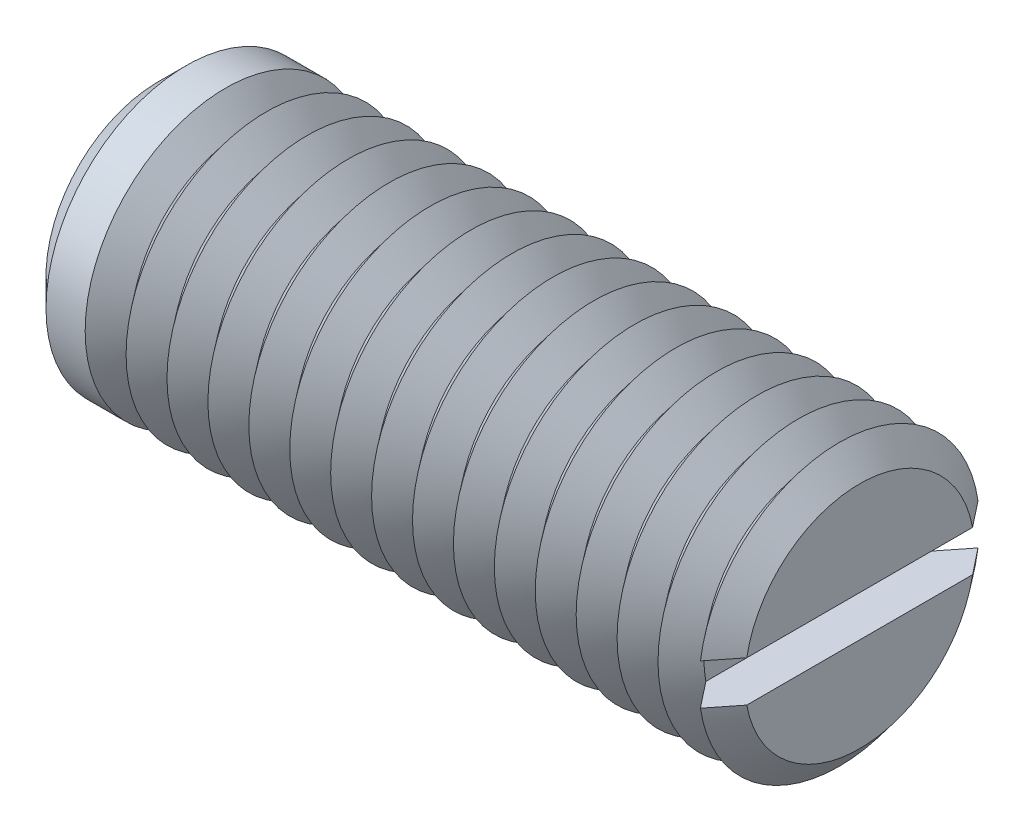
ISO-10303-21;
HEADER;
FILE_DESCRIPTION(('STEP AP214'),'2;1');
FILE_NAME('part.step','',(''),(''),'','','');
FILE_SCHEMA(('AUTOMOTIVE_DESIGN { 1 0 10303 214 1 1 1 1 }'));
ENDSEC;
DATA;
#1=APPLICATION_CONTEXT('core data for automotive mechanical design processes');
#2=APPLICATION_PROTOCOL_DEFINITION('international standard','automotive_design',2000,#1);
#3=PRODUCT_CONTEXT('',#1,'mechanical');
#4=PRODUCT('Part','Part','',(#3));
#5=PRODUCT_RELATED_PRODUCT_CATEGORY('part','',(#4));
#6=PRODUCT_DEFINITION_FORMATION('','',#4);
#7=PRODUCT_DEFINITION_CONTEXT('part definition',#1,'design');
#8=PRODUCT_DEFINITION('design','',#6,#7);
#9=PRODUCT_DEFINITION_SHAPE('','',#8);
#10=(LENGTH_UNIT() NAMED_UNIT(*) SI_UNIT(.MILLI.,.METRE.));
#11=(NAMED_UNIT(*) PLANE_ANGLE_UNIT() SI_UNIT($,.RADIAN.));
#12=(NAMED_UNIT(*) SI_UNIT($,.STERADIAN.) SOLID_ANGLE_UNIT());
#13=UNCERTAINTY_MEASURE_WITH_UNIT(LENGTH_MEASURE(1.E-05),#10,'distance_accuracy_value','');
#14=(GEOMETRIC_REPRESENTATION_CONTEXT(3) GLOBAL_UNCERTAINTY_ASSIGNED_CONTEXT((#13)) GLOBAL_UNIT_ASSIGNED_CONTEXT((#10,
#11,#12)) REPRESENTATION_CONTEXT('',''));
#15=CARTESIAN_POINT('',(0.,0.,0.));
#16=DIRECTION('',(0.,0.,1.));
#17=DIRECTION('',(1.,0.,0.));
#18=AXIS2_PLACEMENT_3D('',#15,#16,#17);
#19=CARTESIAN_POINT('',(14.125,0.,0.));
#20=DIRECTION('',(1.,0.,0.));
#21=DIRECTION('',(0.,0.,-1.));
#22=AXIS2_PLACEMENT_3D('',#19,#20,#21);
#23=CONICAL_SURFACE('',#22,6.,0.895664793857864);
#24=CARTESIAN_POINT('',(14.125,0.,0.));
#25=DIRECTION('',(-1.,0.,0.));
#26=DIRECTION('',(0.,0.,1.));
#27=AXIS2_PLACEMENT_3D('',#24,#25,#26);
#28=CIRCLE('',#27,6.);
#29=CARTESIAN_POINT('',(14.125,-0.874999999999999,-5.93585503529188));
#30=VERTEX_POINT('',#29);
#31=CARTESIAN_POINT('',(14.125,-0.874999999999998,5.93585503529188));
#32=VERTEX_POINT('',#31);
#33=EDGE_CURVE('E117',#30,#32,#28,.T.);
#34=ORIENTED_EDGE('',*,*,#33,.T.);
#35=CARTESIAN_POINT('',(19.815666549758,-0.874999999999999,-13.0784023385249));
#36=CARTESIAN_POINT('',(19.4425848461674,-0.874999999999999,-12.6113718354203));
#37=CARTESIAN_POINT('',(19.0695485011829,-0.874999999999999,-12.1443050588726));
#38=CARTESIAN_POINT('',(18.3235952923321,-0.874999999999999,-11.2100035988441));
#39=CARTESIAN_POINT('',(17.9506784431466,-0.874999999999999,-10.7427689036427));
#40=CARTESIAN_POINT('',(17.2043910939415,-0.874999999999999,-9.80728158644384));
#41=CARTESIAN_POINT('',(16.831020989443,-0.874999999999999,-9.33902864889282));
#42=CARTESIAN_POINT('',(16.084654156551,-0.874999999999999,-8.40229688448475));
#43=CARTESIAN_POINT('',(15.7116573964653,-0.874999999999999,-7.93381808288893));
#44=CARTESIAN_POINT('',(15.1431910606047,-0.874999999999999,-7.21894008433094));
#45=CARTESIAN_POINT('',(14.9475150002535,-0.874999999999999,-6.97270509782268));
#46=CARTESIAN_POINT('',(14.5563780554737,-0.874999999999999,-6.48006014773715));
#47=CARTESIAN_POINT('',(14.3609171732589,-0.874999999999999,-6.2336501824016));
#48=CARTESIAN_POINT('',(13.9702437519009,-0.874999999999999,-5.74051596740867));
#49=CARTESIAN_POINT('',(13.775031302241,-0.874999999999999,-5.49379164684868));
#50=CARTESIAN_POINT('',(13.3850627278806,-0.874999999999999,-4.99999724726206));
#51=CARTESIAN_POINT('',(13.1903065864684,-0.874999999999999,-4.75292718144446));
#52=CARTESIAN_POINT('',(12.8017454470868,-0.874999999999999,-4.25854698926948));
#53=CARTESIAN_POINT('',(12.6079395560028,-0.874999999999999,-4.01123756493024));
#54=CARTESIAN_POINT('',(12.2214614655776,-0.874999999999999,-3.5156763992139));
#55=CARTESIAN_POINT('',(12.0287894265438,-0.874999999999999,-3.26742453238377));
#56=CARTESIAN_POINT('',(11.7415141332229,-0.874999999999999,-2.89382702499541));
#57=CARTESIAN_POINT('',(11.6460716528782,-0.874999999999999,-2.76912721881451));
#58=CARTESIAN_POINT('',(11.4560120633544,-0.874999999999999,-2.51908954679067));
#59=CARTESIAN_POINT('',(11.3613949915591,-0.874999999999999,-2.39375165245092));
#60=CARTESIAN_POINT('',(11.1734585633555,-0.874999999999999,-2.14215479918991));
#61=CARTESIAN_POINT('',(11.0801388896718,-0.874999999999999,-2.01589607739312));
#62=CARTESIAN_POINT('',(10.8955738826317,-0.874999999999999,-1.7618740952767));
#63=CARTESIAN_POINT('',(10.8043283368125,-0.874999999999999,-1.63411099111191));
#64=CARTESIAN_POINT('',(10.6947335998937,-0.874999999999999,-1.47575777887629));
#65=CARTESIAN_POINT('',(10.6745750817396,-0.874999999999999,-1.44642115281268));
#66=CARTESIAN_POINT('',(10.6344943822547,-0.874999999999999,-1.38758643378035));
#67=CARTESIAN_POINT('',(10.6145722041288,-0.874999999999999,-1.35808833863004));
#68=CARTESIAN_POINT('',(10.5552118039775,-0.874999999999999,-1.26931303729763));
#69=CARTESIAN_POINT('',(10.5161833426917,-0.874999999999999,-1.20976002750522));
#70=CARTESIAN_POINT('',(10.439598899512,-0.874999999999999,-1.08955604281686));
#71=CARTESIAN_POINT('',(10.4020457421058,-0.874999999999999,-1.02890325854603));
#72=CARTESIAN_POINT('',(10.3292052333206,-0.874999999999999,-0.906252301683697));
#73=CARTESIAN_POINT('',(10.2939174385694,-0.874999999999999,-0.844254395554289));
#74=CARTESIAN_POINT('',(10.2387563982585,-0.874999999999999,-0.74080235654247));
#75=CARTESIAN_POINT('',(10.217869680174,-0.874999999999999,-0.699896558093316));
#76=CARTESIAN_POINT('',(10.1780353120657,-0.874999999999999,-0.617162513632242));
#77=CARTESIAN_POINT('',(10.1590880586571,-0.874999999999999,-0.575334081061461));
#78=CARTESIAN_POINT('',(10.106232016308,-0.874999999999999,-0.448426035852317));
#79=CARTESIAN_POINT('',(10.0761075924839,-0.874999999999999,-0.361569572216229));
#80=CARTESIAN_POINT('',(10.0472166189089,-0.874999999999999,-0.240214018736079));
#81=CARTESIAN_POINT('',(10.0406925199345,-0.874999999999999,-0.207555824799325));
#82=CARTESIAN_POINT('',(10.0303887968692,-0.874999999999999,-0.141816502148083));
#83=CARTESIAN_POINT('',(10.0266076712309,-0.874999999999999,-0.108735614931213));
#84=CARTESIAN_POINT('',(10.0220436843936,-0.874999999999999,-0.0424543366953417));
#85=CARTESIAN_POINT('',(10.0212526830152,-0.874999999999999,-0.0092545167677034));
#86=CARTESIAN_POINT('',(10.022702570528,-0.874999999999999,0.0570804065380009));
#87=CARTESIAN_POINT('',(10.0249438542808,-0.874999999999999,0.0902155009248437));
#88=CARTESIAN_POINT('',(10.0331880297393,-0.874999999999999,0.164063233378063));
#89=CARTESIAN_POINT('',(10.0399634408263,-0.874999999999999,0.204689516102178));
#90=CARTESIAN_POINT('',(10.0573167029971,-0.874999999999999,0.285126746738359));
#91=CARTESIAN_POINT('',(10.0678973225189,-0.874999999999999,0.324937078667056));
#92=CARTESIAN_POINT('',(10.0921930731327,-0.874999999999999,0.403898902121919));
#93=CARTESIAN_POINT('',(10.1059311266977,-0.874999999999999,0.443043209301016));
#94=CARTESIAN_POINT('',(10.1357974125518,-0.874999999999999,0.520385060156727));
#95=CARTESIAN_POINT('',(10.151925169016,-0.874999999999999,0.558582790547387));
#96=CARTESIAN_POINT('',(10.2021457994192,-0.874999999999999,0.669991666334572));
#97=CARTESIAN_POINT('',(10.2387706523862,-0.874999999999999,0.74205262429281));
#98=CARTESIAN_POINT('',(10.316117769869,-0.874999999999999,0.883956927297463));
#99=CARTESIAN_POINT('',(10.3568440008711,-0.874999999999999,0.953798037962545));
#100=CARTESIAN_POINT('',(10.4409804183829,-0.874999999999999,1.09208391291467));
#101=CARTESIAN_POINT('',(10.4843973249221,-0.874999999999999,1.16052456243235));
#102=CARTESIAN_POINT('',(10.5729384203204,-0.874999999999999,1.29629435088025));
#103=CARTESIAN_POINT('',(10.618062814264,-0.874999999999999,1.363623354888));
#104=CARTESIAN_POINT('',(10.7096565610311,-0.874999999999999,1.49772496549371));
#105=CARTESIAN_POINT('',(10.7561302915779,-0.874999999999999,1.56449457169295));
#106=CARTESIAN_POINT('',(10.8499281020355,-0.874999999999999,1.6974416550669));
#107=CARTESIAN_POINT('',(10.8972522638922,-0.874999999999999,1.76361907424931));
#108=CARTESIAN_POINT('',(10.9924358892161,-0.874999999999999,1.89539956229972));
#109=CARTESIAN_POINT('',(11.0402941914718,-0.874999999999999,1.96100347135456));
#110=CARTESIAN_POINT('',(11.136481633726,-0.874999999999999,2.0918611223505));
#111=CARTESIAN_POINT('',(11.1848107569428,-0.874999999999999,2.15711487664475));
#112=CARTESIAN_POINT('',(11.3290907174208,-0.874999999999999,2.35079303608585));
#113=CARTESIAN_POINT('',(11.425565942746,-0.874999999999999,2.47882657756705));
#114=CARTESIAN_POINT('',(11.6194152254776,-0.874999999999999,2.7342119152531));
#115=CARTESIAN_POINT('',(11.716789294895,-0.874999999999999,2.86156370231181));
#116=CARTESIAN_POINT('',(12.0098183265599,-0.874999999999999,3.24294102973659));
#117=CARTESIAN_POINT('',(12.2063709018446,-0.874999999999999,3.49627631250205));
#118=CARTESIAN_POINT('',(12.6008478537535,-0.874999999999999,4.00219025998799));
#119=CARTESIAN_POINT('',(12.7987731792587,-0.874999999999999,4.25476818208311));
#120=CARTESIAN_POINT('',(13.1953507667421,-0.874999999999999,4.7593421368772));
#121=CARTESIAN_POINT('',(13.3940030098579,-0.874999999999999,5.01133818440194));
#122=CARTESIAN_POINT('',(13.7908446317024,-0.874999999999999,5.51379367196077));
#123=CARTESIAN_POINT('',(13.9890318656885,-0.874999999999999,5.76425480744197));
#124=CARTESIAN_POINT('',(14.3857195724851,-0.874999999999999,6.26493161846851));
#125=CARTESIAN_POINT('',(14.5842200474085,-0.874999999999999,6.51514729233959));
#126=CARTESIAN_POINT('',(15.1799499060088,-0.874999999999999,7.26541710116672));
#127=CARTESIAN_POINT('',(15.5775028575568,-0.874999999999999,7.76521426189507));
#128=CARTESIAN_POINT('',(16.2943115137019,-0.874999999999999,8.66550309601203));
#129=CARTESIAN_POINT('',(16.6134832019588,-0.874999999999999,9.0660617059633));
#130=CARTESIAN_POINT('',(17.2520581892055,-0.874999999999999,9.86704239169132));
#131=CARTESIAN_POINT('',(17.5714615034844,-0.874999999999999,10.2674644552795));
#132=CARTESIAN_POINT('',(18.2116162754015,-0.874999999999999,11.0697025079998));
#133=CARTESIAN_POINT('',(18.5323682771,-0.874999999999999,11.4715180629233));
#134=CARTESIAN_POINT('',(19.1739570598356,-0.874999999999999,12.2750327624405));
#135=CARTESIAN_POINT('',(19.4947938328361,-0.874999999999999,12.6767319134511));
#136=CARTESIAN_POINT('',(19.815666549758,-0.874999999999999,13.0784023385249));
#137=B_SPLINE_CURVE_WITH_KNOTS('',3,(#35,#36,#37,#38,#39,#40,#41,#42,#43,#44,#45,#46,#47,#48,
#49,#50,#51,#52,#53,#54,#55,#56,#57,#58,#59,#60,#61,#62,#63,#64,#65,#66,#67,#68,#69,#70,#71,#72,
#73,#74,#75,#76,#77,#78,#79,#80,#81,#82,#83,#84,#85,#86,#87,#88,#89,#90,#91,#92,#93,#94,#95,#96,
#97,#98,#99,#100,#101,#102,#103,#104,#105,#106,#107,#108,#109,#110,#111,#112,#113,#114,#115,
#116,#117,#118,#119,#120,#121,#122,#123,#124,#125,#126,#127,#128,#129,#130,#131,#132,#133,#134,
#135,#136),.UNSPECIFIED.,.F.,.F.,(4,2,2,2,2,2,2,2,2,2,2,2,2,2,2,2,2,2,2,2,2,2,2,2,2,2,2,2,2,2,2,
2,2,2,2,2,2,2,2,2,2,2,2,2,2,2,2,2,2,2,4),(0.,1.7932560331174,3.58668207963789,5.3833440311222,
7.17983772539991,8.12338791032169,9.06694771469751,10.0107838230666,10.9545848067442,
11.8971886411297,12.8399226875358,13.3110192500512,13.7821370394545,14.2531375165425,
14.72408952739,14.8308734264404,14.9376587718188,15.1512485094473,15.3652290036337,
15.5791674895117,15.7169026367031,15.8546658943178,16.1289739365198,16.2287885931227,
16.3285485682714,16.4280367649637,16.5275379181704,16.6508760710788,16.7743041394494,
16.8986582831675,17.0229876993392,17.2652294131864,17.5077076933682,17.7508180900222,
17.9939577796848,18.2380016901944,18.4820692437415,18.7256822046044,18.9692865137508,
19.4502162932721,19.9311525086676,20.8930708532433,21.8557381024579,22.8183805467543,
23.776545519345,24.7347169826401,26.6505999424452,28.1871088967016,29.7237307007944,
31.2661438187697,32.8084427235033),.UNSPECIFIED.);
#138=CARTESIAN_POINT('',(13.25,-0.874999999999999,4.82848363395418));
#139=VERTEX_POINT('',#138);
#140=EDGE_CURVE('E109',#139,#32,#137,.T.);
#141=ORIENTED_EDGE('',*,*,#140,.F.);
#142=CARTESIAN_POINT('',(13.25,0.,0.));
#143=DIRECTION('',(-1.,0.,0.));
#144=DIRECTION('',(0.,0.,1.));
#145=AXIS2_PLACEMENT_3D('',#142,#143,#144);
#146=CIRCLE('',#145,4.90712535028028);
#147=CARTESIAN_POINT('',(13.25,-0.874999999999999,-4.82848363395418));
#148=VERTEX_POINT('',#147);
#149=EDGE_CURVE('E344',#148,#139,#146,.T.);
#150=ORIENTED_EDGE('',*,*,#149,.F.);
#151=EDGE_CURVE('E58',#30,#148,#137,.T.);
#152=ORIENTED_EDGE('',*,*,#151,.F.);
#153=EDGE_LOOP('',(#34,#141,#150,#152));
#154=FACE_BOUND('',#153,.T.);
#155=ADVANCED_FACE('F37',(#154),#23,.T.);
#156=CARTESIAN_POINT('',(14.125,0.874999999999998,5.93585503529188));
#157=VERTEX_POINT('',#156);
#158=CARTESIAN_POINT('',(14.125,0.874999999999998,-5.93585503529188));
#159=VERTEX_POINT('',#158);
#160=EDGE_CURVE('E100',#157,#159,#28,.T.);
#161=ORIENTED_EDGE('',*,*,#160,.T.);
#162=CARTESIAN_POINT('',(19.815666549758,0.874999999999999,13.0784023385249));
#163=CARTESIAN_POINT('',(19.4425848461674,0.874999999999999,12.6113718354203));
#164=CARTESIAN_POINT('',(19.0695485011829,0.874999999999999,12.1443050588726));
#165=CARTESIAN_POINT('',(18.3235952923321,0.874999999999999,11.2100035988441));
#166=CARTESIAN_POINT('',(17.9506784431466,0.874999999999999,10.7427689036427));
#167=CARTESIAN_POINT('',(17.2043910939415,0.874999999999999,9.80728158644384));
#168=CARTESIAN_POINT('',(16.831020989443,0.874999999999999,9.33902864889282));
#169=CARTESIAN_POINT('',(16.084654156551,0.874999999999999,8.40229688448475));
#170=CARTESIAN_POINT('',(15.7116573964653,0.874999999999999,7.93381808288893));
#171=CARTESIAN_POINT('',(15.1431910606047,0.874999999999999,7.21894008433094));
#172=CARTESIAN_POINT('',(14.9475150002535,0.874999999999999,6.97270509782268));
#173=CARTESIAN_POINT('',(14.5563780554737,0.874999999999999,6.48006014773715));
#174=CARTESIAN_POINT('',(14.3609171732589,0.874999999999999,6.2336501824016));
#175=CARTESIAN_POINT('',(13.9702437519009,0.874999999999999,5.74051596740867));
#176=CARTESIAN_POINT('',(13.775031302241,0.874999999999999,5.49379164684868));
#177=CARTESIAN_POINT('',(13.3850627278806,0.874999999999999,4.99999724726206));
#178=CARTESIAN_POINT('',(13.1903065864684,0.874999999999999,4.75292718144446));
#179=CARTESIAN_POINT('',(12.8017454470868,0.874999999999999,4.25854698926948));
#180=CARTESIAN_POINT('',(12.6079395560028,0.874999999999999,4.01123756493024));
#181=CARTESIAN_POINT('',(12.2214614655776,0.874999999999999,3.5156763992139));
#182=CARTESIAN_POINT('',(12.0287894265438,0.874999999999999,3.26742453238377));
#183=CARTESIAN_POINT('',(11.7415141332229,0.874999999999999,2.89382702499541));
#184=CARTESIAN_POINT('',(11.6460716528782,0.874999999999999,2.76912721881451));
#185=CARTESIAN_POINT('',(11.4560120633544,0.874999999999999,2.51908954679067));
#186=CARTESIAN_POINT('',(11.3613949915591,0.874999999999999,2.39375165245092));
#187=CARTESIAN_POINT('',(11.1734585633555,0.874999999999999,2.14215479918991));
#188=CARTESIAN_POINT('',(11.0801388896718,0.874999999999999,2.01589607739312));
#189=CARTESIAN_POINT('',(10.8955738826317,0.874999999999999,1.7618740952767));
#190=CARTESIAN_POINT('',(10.8043283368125,0.874999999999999,1.63411099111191));
#191=CARTESIAN_POINT('',(10.6947335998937,0.874999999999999,1.47575777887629));
#192=CARTESIAN_POINT('',(10.6745750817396,0.874999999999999,1.44642115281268));
#193=CARTESIAN_POINT('',(10.6344943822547,0.874999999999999,1.38758643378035));
#194=CARTESIAN_POINT('',(10.6145722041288,0.874999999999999,1.35808833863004));
#195=CARTESIAN_POINT('',(10.5552118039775,0.874999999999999,1.26931303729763));
#196=CARTESIAN_POINT('',(10.5161833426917,0.874999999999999,1.20976002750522));
#197=CARTESIAN_POINT('',(10.439598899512,0.874999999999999,1.08955604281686));
#198=CARTESIAN_POINT('',(10.4020457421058,0.874999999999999,1.02890325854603));
#199=CARTESIAN_POINT('',(10.3292052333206,0.874999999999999,0.906252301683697));
#200=CARTESIAN_POINT('',(10.2939174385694,0.874999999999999,0.844254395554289));
#201=CARTESIAN_POINT('',(10.2387563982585,0.874999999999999,0.74080235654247));
#202=CARTESIAN_POINT('',(10.217869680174,0.874999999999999,0.699896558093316));
#203=CARTESIAN_POINT('',(10.1780353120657,0.874999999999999,0.617162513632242));
#204=CARTESIAN_POINT('',(10.1590880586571,0.874999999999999,0.575334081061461));
#205=CARTESIAN_POINT('',(10.106232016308,0.874999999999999,0.448426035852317));
#206=CARTESIAN_POINT('',(10.0761075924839,0.874999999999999,0.361569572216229));
#207=CARTESIAN_POINT('',(10.0472166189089,0.874999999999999,0.240214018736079));
#208=CARTESIAN_POINT('',(10.0406925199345,0.874999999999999,0.207555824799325));
#209=CARTESIAN_POINT('',(10.0303887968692,0.874999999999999,0.141816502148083));
#210=CARTESIAN_POINT('',(10.0266076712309,0.874999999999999,0.108735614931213));
#211=CARTESIAN_POINT('',(10.0220436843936,0.874999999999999,0.0424543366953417));
#212=CARTESIAN_POINT('',(10.0212526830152,0.874999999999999,0.0092545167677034));
#213=CARTESIAN_POINT('',(10.022702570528,0.874999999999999,-0.0570804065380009));
#214=CARTESIAN_POINT('',(10.0249438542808,0.874999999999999,-0.0902155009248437));
#215=CARTESIAN_POINT('',(10.0331880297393,0.874999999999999,-0.164063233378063));
#216=CARTESIAN_POINT('',(10.0399634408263,0.874999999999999,-0.204689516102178));
#217=CARTESIAN_POINT('',(10.0573167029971,0.874999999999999,-0.285126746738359));
#218=CARTESIAN_POINT('',(10.0678973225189,0.874999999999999,-0.324937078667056));
#219=CARTESIAN_POINT('',(10.0921930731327,0.874999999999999,-0.403898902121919));
#220=CARTESIAN_POINT('',(10.1059311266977,0.874999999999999,-0.443043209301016));
#221=CARTESIAN_POINT('',(10.1357974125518,0.874999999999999,-0.520385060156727));
#222=CARTESIAN_POINT('',(10.151925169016,0.874999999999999,-0.558582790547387));
#223=CARTESIAN_POINT('',(10.2021457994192,0.874999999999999,-0.669991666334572));
#224=CARTESIAN_POINT('',(10.2387706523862,0.874999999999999,-0.74205262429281));
#225=CARTESIAN_POINT('',(10.316117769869,0.874999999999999,-0.883956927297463));
#226=CARTESIAN_POINT('',(10.3568440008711,0.874999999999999,-0.953798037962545));
#227=CARTESIAN_POINT('',(10.4409804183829,0.874999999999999,-1.09208391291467));
#228=CARTESIAN_POINT('',(10.4843973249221,0.874999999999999,-1.16052456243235));
#229=CARTESIAN_POINT('',(10.5729384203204,0.874999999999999,-1.29629435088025));
#230=CARTESIAN_POINT('',(10.618062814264,0.874999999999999,-1.363623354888));
#231=CARTESIAN_POINT('',(10.7096565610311,0.874999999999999,-1.49772496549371));
#232=CARTESIAN_POINT('',(10.7561302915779,0.874999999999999,-1.56449457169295));
#233=CARTESIAN_POINT('',(10.8499281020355,0.874999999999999,-1.6974416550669));
#234=CARTESIAN_POINT('',(10.8972522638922,0.874999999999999,-1.76361907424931));
#235=CARTESIAN_POINT('',(10.9924358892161,0.874999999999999,-1.89539956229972));
#236=CARTESIAN_POINT('',(11.0402941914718,0.874999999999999,-1.96100347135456));
#237=CARTESIAN_POINT('',(11.136481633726,0.874999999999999,-2.0918611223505));
#238=CARTESIAN_POINT('',(11.1848107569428,0.874999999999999,-2.15711487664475));
#239=CARTESIAN_POINT('',(11.3290907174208,0.874999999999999,-2.35079303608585));
#240=CARTESIAN_POINT('',(11.425565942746,0.874999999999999,-2.47882657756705));
#241=CARTESIAN_POINT('',(11.6194152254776,0.874999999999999,-2.7342119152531));
#242=CARTESIAN_POINT('',(11.716789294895,0.874999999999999,-2.86156370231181));
#243=CARTESIAN_POINT('',(12.0098183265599,0.874999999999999,-3.24294102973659));
#244=CARTESIAN_POINT('',(12.2063709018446,0.874999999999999,-3.49627631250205));
#245=CARTESIAN_POINT('',(12.6008478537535,0.874999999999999,-4.00219025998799));
#246=CARTESIAN_POINT('',(12.7987731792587,0.874999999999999,-4.25476818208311));
#247=CARTESIAN_POINT('',(13.1953507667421,0.874999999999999,-4.7593421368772));
#248=CARTESIAN_POINT('',(13.3940030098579,0.874999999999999,-5.01133818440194));
#249=CARTESIAN_POINT('',(13.7908446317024,0.874999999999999,-5.51379367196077));
#250=CARTESIAN_POINT('',(13.9890318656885,0.874999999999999,-5.76425480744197));
#251=CARTESIAN_POINT('',(14.3857195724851,0.874999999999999,-6.26493161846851));
#252=CARTESIAN_POINT('',(14.5842200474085,0.874999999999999,-6.51514729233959));
#253=CARTESIAN_POINT('',(15.1799499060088,0.874999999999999,-7.26541710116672));
#254=CARTESIAN_POINT('',(15.5775028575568,0.874999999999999,-7.76521426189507));
#255=CARTESIAN_POINT('',(16.2943115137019,0.874999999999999,-8.66550309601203));
#256=CARTESIAN_POINT('',(16.6134832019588,0.874999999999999,-9.0660617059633));
#257=CARTESIAN_POINT('',(17.2520581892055,0.874999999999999,-9.86704239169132));
#258=CARTESIAN_POINT('',(17.5714615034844,0.874999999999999,-10.2674644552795));
#259=CARTESIAN_POINT('',(18.2116162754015,0.874999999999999,-11.0697025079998));
#260=CARTESIAN_POINT('',(18.5323682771,0.874999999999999,-11.4715180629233));
#261=CARTESIAN_POINT('',(19.1739570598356,0.874999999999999,-12.2750327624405));
#262=CARTESIAN_POINT('',(19.4947938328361,0.874999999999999,-12.6767319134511));
#263=CARTESIAN_POINT('',(19.815666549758,0.874999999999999,-13.0784023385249));
#264=B_SPLINE_CURVE_WITH_KNOTS('',3,(#162,#163,#164,#165,#166,#167,#168,#169,#170,#171,#172,
#173,#174,#175,#176,#177,#178,#179,#180,#181,#182,#183,#184,#185,#186,#187,#188,#189,#190,#191,
#192,#193,#194,#195,#196,#197,#198,#199,#200,#201,#202,#203,#204,#205,#206,#207,#208,#209,#210,
#211,#212,#213,#214,#215,#216,#217,#218,#219,#220,#221,#222,#223,#224,#225,#226,#227,#228,#229,
#230,#231,#232,#233,#234,#235,#236,#237,#238,#239,#240,#241,#242,#243,#244,#245,#246,#247,#248,
#249,#250,#251,#252,#253,#254,#255,#256,#257,#258,#259,#260,#261,#262,#263),.UNSPECIFIED.,.F.,
.F.,(4,2,2,2,2,2,2,2,2,2,2,2,2,2,2,2,2,2,2,2,2,2,2,2,2,2,2,2,2,2,2,2,2,2,2,2,2,2,2,2,2,2,2,2,2,
2,2,2,2,2,4),(0.,1.7932560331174,3.58668207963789,5.3833440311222,7.17983772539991,
8.12338791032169,9.06694771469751,10.0107838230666,10.9545848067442,11.8971886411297,
12.8399226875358,13.3110192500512,13.7821370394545,14.2531375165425,14.72408952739,
14.8308734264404,14.9376587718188,15.1512485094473,15.3652290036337,15.5791674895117,
15.7169026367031,15.8546658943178,16.1289739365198,16.2287885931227,16.3285485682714,
16.4280367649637,16.5275379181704,16.6508760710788,16.7743041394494,16.8986582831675,
17.0229876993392,17.2652294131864,17.5077076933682,17.7508180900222,17.9939577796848,
18.2380016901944,18.4820692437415,18.7256822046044,18.9692865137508,19.4502162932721,
19.9311525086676,20.8930708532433,21.8557381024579,22.8183805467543,23.776545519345,
24.7347169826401,26.6505999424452,28.1871088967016,29.7237307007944,31.2661438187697,
32.8084427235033),.UNSPECIFIED.);
#265=CARTESIAN_POINT('',(13.25,0.874999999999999,-4.82848363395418));
#266=VERTEX_POINT('',#265);
#267=EDGE_CURVE('E110',#266,#159,#264,.T.);
#268=ORIENTED_EDGE('',*,*,#267,.F.);
#269=CARTESIAN_POINT('',(13.25,0.874999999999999,4.82848363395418));
#270=VERTEX_POINT('',#269);
#271=EDGE_CURVE('E103',#270,#266,#146,.T.);
#272=ORIENTED_EDGE('',*,*,#271,.F.);
#273=EDGE_CURVE('E97',#157,#270,#264,.T.);
#274=ORIENTED_EDGE('',*,*,#273,.F.);
#275=EDGE_LOOP('',(#161,#268,#272,#274));
#276=FACE_BOUND('',#275,.T.);
#277=ADVANCED_FACE('F99',(#276),#23,.T.);
#278=CARTESIAN_POINT('',(13.25,0.,0.));
#279=DIRECTION('',(-1.,0.,0.));
#280=DIRECTION('',(0.,0.,1.));
#281=AXIS2_PLACEMENT_3D('',#278,#279,#280);
#282=CONICAL_SURFACE('',#281,4.90712535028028,0.895664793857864);
#283=CARTESIAN_POINT('',(12.375,0.,0.));
#284=DIRECTION('',(-1.,0.,0.));
#285=DIRECTION('',(0.,0.,1.));
#286=AXIS2_PLACEMENT_3D('',#283,#284,#285);
#287=CIRCLE('',#286,6.);
#288=CARTESIAN_POINT('',(12.375,0.,6.));
#289=VERTEX_POINT('',#288);
#290=EDGE_CURVE('E330',#289,#289,#287,.T.);
#291=ORIENTED_EDGE('',*,*,#290,.F.);
#292=EDGE_LOOP('',(#291));
#293=FACE_BOUND('',#292,.T.);
#294=ORIENTED_EDGE('',*,*,#271,.T.);
#295=EDGE_CURVE('E338',#266,#148,#146,.T.);
#296=ORIENTED_EDGE('',*,*,#295,.T.);
#297=ORIENTED_EDGE('',*,*,#149,.T.);
#298=EDGE_CURVE('E336',#139,#270,#146,.T.);
#299=ORIENTED_EDGE('',*,*,#298,.T.);
#300=EDGE_LOOP('',(#294,#296,#297,#299));
#301=FACE_BOUND('',#300,.T.);
#302=ADVANCED_FACE('F166',(#293,#301),#282,.T.);
#303=CARTESIAN_POINT('',(15.,0.,0.));
#304=DIRECTION('',(1.,0.,0.));
#305=DIRECTION('',(0.,0.,-1.));
#306=AXIS2_PLACEMENT_3D('',#303,#304,#305);
#307=PLANE('',#306);
#308=CARTESIAN_POINT('',(15.,0.,0.));
#309=DIRECTION('',(-1.,0.,0.));
#310=DIRECTION('',(0.,0.,1.));
#311=AXIS2_PLACEMENT_3D('',#308,#309,#310);
#312=CIRCLE('',#311,4.90712535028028);
#313=CARTESIAN_POINT('',(15.,0.874999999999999,4.82848363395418));
#314=VERTEX_POINT('',#313);
#315=CARTESIAN_POINT('',(15.,0.874999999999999,-4.82848363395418));
#316=VERTEX_POINT('',#315);
#317=EDGE_CURVE('E158',#314,#316,#312,.T.);
#318=ORIENTED_EDGE('',*,*,#317,.F.);
#319=DIRECTION('',(0.,0.,1.));
#320=VECTOR('',#319,1.);
#321=CARTESIAN_POINT('',(15.,0.874999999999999,0.));
#322=LINE('',#321,#320);
#323=EDGE_CURVE('E122',#316,#314,#322,.T.);
#324=ORIENTED_EDGE('',*,*,#323,.F.);
#325=EDGE_LOOP('',(#318,#324));
#326=FACE_BOUND('',#325,.T.);
#327=ADVANCED_FACE('F170',(#326),#307,.T.);
#328=CARTESIAN_POINT('',(15.,-0.874999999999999,-4.82848363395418));
#329=VERTEX_POINT('',#328);
#330=CARTESIAN_POINT('',(15.,-0.874999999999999,4.82848363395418));
#331=VERTEX_POINT('',#330);
#332=EDGE_CURVE('E66',#329,#331,#312,.T.);
#333=ORIENTED_EDGE('',*,*,#332,.F.);
#334=DIRECTION('',(0.,0.,-1.));
#335=VECTOR('',#334,1.);
#336=CARTESIAN_POINT('',(15.,-0.874999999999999,0.));
#337=LINE('',#336,#335);
#338=EDGE_CURVE('E135',#331,#329,#337,.T.);
#339=ORIENTED_EDGE('',*,*,#338,.F.);
#340=EDGE_LOOP('',(#333,#339));
#341=FACE_BOUND('',#340,.T.);
#342=ADVANCED_FACE('F197',(#341),#307,.T.);
#343=CARTESIAN_POINT('',(15.,0.,0.));
#344=DIRECTION('',(-1.,0.,0.));
#345=DIRECTION('',(0.,0.,1.));
#346=AXIS2_PLACEMENT_3D('',#343,#344,#345);
#347=CONICAL_SURFACE('',#346,4.90712535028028,0.895664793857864);
#348=ORIENTED_EDGE('',*,*,#160,.F.);
#349=CARTESIAN_POINT('',(8.43433345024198,0.874999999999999,-13.0784023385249));
#350=CARTESIAN_POINT('',(8.80741515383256,0.874999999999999,-12.6113718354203));
#351=CARTESIAN_POINT('',(9.1804514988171,0.874999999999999,-12.1443050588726));
#352=CARTESIAN_POINT('',(9.92640470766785,0.874999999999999,-11.2100035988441));
#353=CARTESIAN_POINT('',(10.2993215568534,0.874999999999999,-10.7427689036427));
#354=CARTESIAN_POINT('',(11.0456089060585,0.874999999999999,-9.80728158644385));
#355=CARTESIAN_POINT('',(11.4189790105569,0.874999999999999,-9.33902864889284));
#356=CARTESIAN_POINT('',(12.165345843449,0.874999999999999,-8.40229688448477));
#357=CARTESIAN_POINT('',(12.5383426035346,0.874999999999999,-7.93381808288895));
#358=CARTESIAN_POINT('',(13.1068089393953,0.874999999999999,-7.21894008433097));
#359=CARTESIAN_POINT('',(13.3024849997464,0.874999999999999,-6.9727050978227));
#360=CARTESIAN_POINT('',(13.6936219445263,0.874999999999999,-6.48006014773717));
#361=CARTESIAN_POINT('',(13.8890828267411,0.874999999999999,-6.23365018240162));
#362=CARTESIAN_POINT('',(14.2797562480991,0.874999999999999,-5.74051596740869));
#363=CARTESIAN_POINT('',(14.4749686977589,0.874999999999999,-5.4937916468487));
#364=CARTESIAN_POINT('',(14.8649372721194,0.874999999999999,-4.99999724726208));
#365=CARTESIAN_POINT('',(15.0596934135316,0.874999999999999,-4.75292718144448));
#366=CARTESIAN_POINT('',(15.4482545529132,0.874999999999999,-4.2585469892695));
#367=CARTESIAN_POINT('',(15.6420604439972,0.874999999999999,-4.01123756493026));
#368=CARTESIAN_POINT('',(16.0285385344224,0.874999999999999,-3.51567639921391));
#369=CARTESIAN_POINT('',(16.2212105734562,0.874999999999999,-3.26742453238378));
#370=CARTESIAN_POINT('',(16.5084858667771,0.874999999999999,-2.89382702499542));
#371=CARTESIAN_POINT('',(16.6039283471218,0.874999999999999,-2.76912721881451));
#372=CARTESIAN_POINT('',(16.7939879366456,0.874999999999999,-2.51908954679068));
#373=CARTESIAN_POINT('',(16.8886050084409,0.874999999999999,-2.39375165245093));
#374=CARTESIAN_POINT('',(17.0765414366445,0.874999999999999,-2.14215479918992));
#375=CARTESIAN_POINT('',(17.1698611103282,0.874999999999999,-2.01589607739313));
#376=CARTESIAN_POINT('',(17.3544261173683,0.874999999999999,-1.7618740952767));
#377=CARTESIAN_POINT('',(17.4456716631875,0.874999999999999,-1.63411099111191));
#378=CARTESIAN_POINT('',(17.5552664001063,0.874999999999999,-1.47575777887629));
#379=CARTESIAN_POINT('',(17.5754249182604,0.874999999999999,-1.44642115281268));
#380=CARTESIAN_POINT('',(17.6155056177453,0.874999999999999,-1.38758643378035));
#381=CARTESIAN_POINT('',(17.6354277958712,0.874999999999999,-1.35808833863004));
#382=CARTESIAN_POINT('',(17.6947881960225,0.874999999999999,-1.26931303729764));
#383=CARTESIAN_POINT('',(17.7338166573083,0.874999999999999,-1.20976002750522));
#384=CARTESIAN_POINT('',(17.810401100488,0.874999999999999,-1.08955604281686));
#385=CARTESIAN_POINT('',(17.8479542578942,0.874999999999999,-1.02890325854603));
#386=CARTESIAN_POINT('',(17.9207947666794,0.874999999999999,-0.906252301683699));
#387=CARTESIAN_POINT('',(17.9560825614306,0.874999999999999,-0.84425439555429));
#388=CARTESIAN_POINT('',(18.0112436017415,0.874999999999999,-0.740802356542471));
#389=CARTESIAN_POINT('',(18.032130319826,0.874999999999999,-0.699896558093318));
#390=CARTESIAN_POINT('',(18.0719646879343,0.874999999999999,-0.617162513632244));
#391=CARTESIAN_POINT('',(18.0909119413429,0.874999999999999,-0.575334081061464));
#392=CARTESIAN_POINT('',(18.143767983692,0.874999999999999,-0.448426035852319));
#393=CARTESIAN_POINT('',(18.1738924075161,0.874999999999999,-0.36156957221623));
#394=CARTESIAN_POINT('',(18.2027833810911,0.874999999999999,-0.240214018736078));
#395=CARTESIAN_POINT('',(18.2093074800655,0.874999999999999,-0.207555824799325));
#396=CARTESIAN_POINT('',(18.2196112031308,0.874999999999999,-0.141816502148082));
#397=CARTESIAN_POINT('',(18.2233923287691,0.874999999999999,-0.108735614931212));
#398=CARTESIAN_POINT('',(18.2279563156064,0.874999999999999,-0.0424543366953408));
#399=CARTESIAN_POINT('',(18.2287473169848,0.874999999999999,-0.00925451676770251));
#400=CARTESIAN_POINT('',(18.2272974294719,0.874999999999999,0.0570804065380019));
#401=CARTESIAN_POINT('',(18.2250561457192,0.874999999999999,0.0902155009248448));
#402=CARTESIAN_POINT('',(18.2168119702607,0.874999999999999,0.164063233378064));
#403=CARTESIAN_POINT('',(18.2100365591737,0.874999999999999,0.204689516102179));
#404=CARTESIAN_POINT('',(18.1926832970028,0.874999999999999,0.285126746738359));
#405=CARTESIAN_POINT('',(18.1821026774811,0.874999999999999,0.324937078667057));
#406=CARTESIAN_POINT('',(18.1578069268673,0.874999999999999,0.403898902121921));
#407=CARTESIAN_POINT('',(18.1440688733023,0.874999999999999,0.443043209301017));
#408=CARTESIAN_POINT('',(18.1142025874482,0.874999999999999,0.520385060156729));
#409=CARTESIAN_POINT('',(18.098074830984,0.874999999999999,0.558582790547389));
#410=CARTESIAN_POINT('',(18.0478542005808,0.874999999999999,0.669991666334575));
#411=CARTESIAN_POINT('',(18.0112293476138,0.874999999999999,0.742052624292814));
#412=CARTESIAN_POINT('',(17.933882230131,0.874999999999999,0.883956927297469));
#413=CARTESIAN_POINT('',(17.8931559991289,0.874999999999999,0.953798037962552));
#414=CARTESIAN_POINT('',(17.8090195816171,0.874999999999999,1.09208391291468));
#415=CARTESIAN_POINT('',(17.7656026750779,0.874999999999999,1.16052456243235));
#416=CARTESIAN_POINT('',(17.6770615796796,0.874999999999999,1.29629435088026));
#417=CARTESIAN_POINT('',(17.631937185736,0.874999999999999,1.36362335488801));
#418=CARTESIAN_POINT('',(17.5403434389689,0.874999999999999,1.49772496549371));
#419=CARTESIAN_POINT('',(17.4938697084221,0.874999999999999,1.56449457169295));
#420=CARTESIAN_POINT('',(17.4000718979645,0.874999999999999,1.6974416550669));
#421=CARTESIAN_POINT('',(17.3527477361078,0.874999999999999,1.76361907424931));
#422=CARTESIAN_POINT('',(17.2575641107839,0.874999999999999,1.89539956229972));
#423=CARTESIAN_POINT('',(17.2097058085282,0.874999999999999,1.96100347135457));
#424=CARTESIAN_POINT('',(17.113518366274,0.874999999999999,2.09186112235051));
#425=CARTESIAN_POINT('',(17.0651892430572,0.874999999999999,2.15711487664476));
#426=CARTESIAN_POINT('',(16.9209092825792,0.874999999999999,2.35079303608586));
#427=CARTESIAN_POINT('',(16.824434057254,0.874999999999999,2.47882657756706));
#428=CARTESIAN_POINT('',(16.6305847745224,0.874999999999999,2.73421191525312));
#429=CARTESIAN_POINT('',(16.533210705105,0.874999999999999,2.86156370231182));
#430=CARTESIAN_POINT('',(16.2401816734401,0.874999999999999,3.24294102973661));
#431=CARTESIAN_POINT('',(16.0436290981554,0.874999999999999,3.49627631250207));
#432=CARTESIAN_POINT('',(15.6491521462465,0.874999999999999,4.00219025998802));
#433=CARTESIAN_POINT('',(15.4512268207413,0.874999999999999,4.25476818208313));
#434=CARTESIAN_POINT('',(15.0546492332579,0.874999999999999,4.75934213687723));
#435=CARTESIAN_POINT('',(14.855996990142,0.874999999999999,5.01133818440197));
#436=CARTESIAN_POINT('',(14.4591553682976,0.874999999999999,5.5137936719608));
#437=CARTESIAN_POINT('',(14.2609681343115,0.874999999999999,5.764254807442));
#438=CARTESIAN_POINT('',(13.8642804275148,0.874999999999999,6.26493161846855));
#439=CARTESIAN_POINT('',(13.6657799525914,0.874999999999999,6.51514729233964));
#440=CARTESIAN_POINT('',(13.0700500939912,0.874999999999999,7.26541710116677));
#441=CARTESIAN_POINT('',(12.6724971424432,0.874999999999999,7.76521426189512));
#442=CARTESIAN_POINT('',(11.9556884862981,0.874999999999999,8.66550309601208));
#443=CARTESIAN_POINT('',(11.6365167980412,0.874999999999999,9.06606170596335));
#444=CARTESIAN_POINT('',(10.9979418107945,0.874999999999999,9.86704239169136));
#445=CARTESIAN_POINT('',(10.6785384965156,0.874999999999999,10.2674644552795));
#446=CARTESIAN_POINT('',(10.0383837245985,0.874999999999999,11.0697025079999));
#447=CARTESIAN_POINT('',(9.71763172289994,0.874999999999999,11.4715180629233));
#448=CARTESIAN_POINT('',(9.07604294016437,0.874999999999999,12.2750327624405));
#449=CARTESIAN_POINT('',(8.75520616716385,0.874999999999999,12.6767319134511));
#450=CARTESIAN_POINT('',(8.43433345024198,0.874999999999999,13.0784023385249));
#451=B_SPLINE_CURVE_WITH_KNOTS('',3,(#349,#350,#351,#352,#353,#354,#355,#356,#357,#358,#359,
#360,#361,#362,#363,#364,#365,#366,#367,#368,#369,#370,#371,#372,#373,#374,#375,#376,#377,#378,
#379,#380,#381,#382,#383,#384,#385,#386,#387,#388,#389,#390,#391,#392,#393,#394,#395,#396,#397,
#398,#399,#400,#401,#402,#403,#404,#405,#406,#407,#408,#409,#410,#411,#412,#413,#414,#415,#416,
#417,#418,#419,#420,#421,#422,#423,#424,#425,#426,#427,#428,#429,#430,#431,#432,#433,#434,#435,
#436,#437,#438,#439,#440,#441,#442,#443,#444,#445,#446,#447,#448,#449,#450),.UNSPECIFIED.,.F.,
.F.,(4,2,2,2,2,2,2,2,2,2,2,2,2,2,2,2,2,2,2,2,2,2,2,2,2,2,2,2,2,2,2,2,2,2,2,2,2,2,2,2,2,2,2,2,2,
2,2,2,2,2,4),(0.,1.7932560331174,3.58668207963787,5.38334403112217,7.17983772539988,
8.12338791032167,9.06694771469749,10.0107838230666,10.9545848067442,11.8971886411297,
12.8399226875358,13.3110192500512,13.7821370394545,14.2531375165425,14.72408952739,
14.8308734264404,14.9376587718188,15.1512485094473,15.3652290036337,15.5791674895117,
15.7169026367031,15.8546658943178,16.1289739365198,16.2287885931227,16.3285485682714,
16.4280367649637,16.5275379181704,16.6508760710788,16.7743041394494,16.8986582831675,
17.0229876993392,17.2652294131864,17.5077076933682,17.7508180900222,17.9939577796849,
18.2380016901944,18.4820692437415,18.7256822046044,18.9692865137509,19.4502162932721,
19.9311525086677,20.8930708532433,21.855738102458,22.8183805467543,23.776545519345,
24.7347169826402,26.6505999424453,28.1871088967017,29.7237307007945,31.2661438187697,
32.8084427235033),.UNSPECIFIED.);
#452=EDGE_CURVE('E41',#314,#157,#451,.T.);
#453=ORIENTED_EDGE('',*,*,#452,.F.);
#454=ORIENTED_EDGE('',*,*,#317,.T.);
#455=EDGE_CURVE('E11',#159,#316,#451,.T.);
#456=ORIENTED_EDGE('',*,*,#455,.F.);
#457=EDGE_LOOP('',(#348,#453,#454,#456));
#458=FACE_BOUND('',#457,.T.);
#459=ADVANCED_FACE('F114',(#458),#347,.T.);
#460=CARTESIAN_POINT('',(15.,0.874999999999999,-9.));
#461=DIRECTION('',(0.,1.,0.));
#462=DIRECTION('',(0.,0.,1.));
#463=AXIS2_PLACEMENT_3D('',#460,#461,#462);
#464=PLANE('',#463);
#465=ORIENTED_EDGE('',*,*,#452,.T.);
#466=ORIENTED_EDGE('',*,*,#273,.T.);
#467=DIRECTION('',(0.,0.,1.));
#468=VECTOR('',#467,1.);
#469=CARTESIAN_POINT('',(13.25,0.874999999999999,-9.));
#470=LINE('',#469,#468);
#471=EDGE_CURVE('E144',#266,#270,#470,.T.);
#472=ORIENTED_EDGE('',*,*,#471,.F.);
#473=ORIENTED_EDGE('',*,*,#267,.T.);
#474=ORIENTED_EDGE('',*,*,#455,.T.);
#475=ORIENTED_EDGE('',*,*,#323,.T.);
#476=EDGE_LOOP('',(#465,#466,#472,#473,#474,#475));
#477=FACE_BOUND('',#476,.T.);
#478=ADVANCED_FACE('F120',(#477),#464,.F.);
#479=ORIENTED_EDGE('',*,*,#33,.F.);
#480=CARTESIAN_POINT('',(8.43433345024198,-0.874999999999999,13.0784023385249));
#481=CARTESIAN_POINT('',(8.80741515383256,-0.874999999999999,12.6113718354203));
#482=CARTESIAN_POINT('',(9.1804514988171,-0.874999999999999,12.1443050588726));
#483=CARTESIAN_POINT('',(9.92640470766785,-0.874999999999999,11.2100035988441));
#484=CARTESIAN_POINT('',(10.2993215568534,-0.874999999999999,10.7427689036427));
#485=CARTESIAN_POINT('',(11.0456089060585,-0.874999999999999,9.80728158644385));
#486=CARTESIAN_POINT('',(11.4189790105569,-0.874999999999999,9.33902864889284));
#487=CARTESIAN_POINT('',(12.165345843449,-0.874999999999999,8.40229688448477));
#488=CARTESIAN_POINT('',(12.5383426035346,-0.874999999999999,7.93381808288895));
#489=CARTESIAN_POINT('',(13.1068089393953,-0.874999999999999,7.21894008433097));
#490=CARTESIAN_POINT('',(13.3024849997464,-0.874999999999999,6.9727050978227));
#491=CARTESIAN_POINT('',(13.6936219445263,-0.874999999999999,6.48006014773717));
#492=CARTESIAN_POINT('',(13.8890828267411,-0.874999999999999,6.23365018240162));
#493=CARTESIAN_POINT('',(14.2797562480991,-0.874999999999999,5.74051596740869));
#494=CARTESIAN_POINT('',(14.4749686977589,-0.874999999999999,5.4937916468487));
#495=CARTESIAN_POINT('',(14.8649372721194,-0.874999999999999,4.99999724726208));
#496=CARTESIAN_POINT('',(15.0596934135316,-0.874999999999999,4.75292718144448));
#497=CARTESIAN_POINT('',(15.4482545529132,-0.874999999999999,4.2585469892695));
#498=CARTESIAN_POINT('',(15.6420604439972,-0.874999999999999,4.01123756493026));
#499=CARTESIAN_POINT('',(16.0285385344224,-0.874999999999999,3.51567639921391));
#500=CARTESIAN_POINT('',(16.2212105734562,-0.874999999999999,3.26742453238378));
#501=CARTESIAN_POINT('',(16.5084858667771,-0.874999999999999,2.89382702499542));
#502=CARTESIAN_POINT('',(16.6039283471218,-0.874999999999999,2.76912721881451));
#503=CARTESIAN_POINT('',(16.7939879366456,-0.874999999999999,2.51908954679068));
#504=CARTESIAN_POINT('',(16.8886050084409,-0.874999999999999,2.39375165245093));
#505=CARTESIAN_POINT('',(17.0765414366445,-0.874999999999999,2.14215479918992));
#506=CARTESIAN_POINT('',(17.1698611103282,-0.874999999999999,2.01589607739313));
#507=CARTESIAN_POINT('',(17.3544261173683,-0.874999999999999,1.7618740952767));
#508=CARTESIAN_POINT('',(17.4456716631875,-0.874999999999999,1.63411099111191));
#509=CARTESIAN_POINT('',(17.5552664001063,-0.874999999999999,1.47575777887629));
#510=CARTESIAN_POINT('',(17.5754249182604,-0.874999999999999,1.44642115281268));
#511=CARTESIAN_POINT('',(17.6155056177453,-0.874999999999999,1.38758643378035));
#512=CARTESIAN_POINT('',(17.6354277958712,-0.874999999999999,1.35808833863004));
#513=CARTESIAN_POINT('',(17.6947881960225,-0.874999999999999,1.26931303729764));
#514=CARTESIAN_POINT('',(17.7338166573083,-0.874999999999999,1.20976002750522));
#515=CARTESIAN_POINT('',(17.810401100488,-0.874999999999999,1.08955604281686));
#516=CARTESIAN_POINT('',(17.8479542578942,-0.874999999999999,1.02890325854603));
#517=CARTESIAN_POINT('',(17.9207947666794,-0.874999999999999,0.906252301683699));
#518=CARTESIAN_POINT('',(17.9560825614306,-0.874999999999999,0.84425439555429));
#519=CARTESIAN_POINT('',(18.0112436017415,-0.874999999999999,0.740802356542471));
#520=CARTESIAN_POINT('',(18.032130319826,-0.874999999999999,0.699896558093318));
#521=CARTESIAN_POINT('',(18.0719646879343,-0.874999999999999,0.617162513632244));
#522=CARTESIAN_POINT('',(18.0909119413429,-0.874999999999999,0.575334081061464));
#523=CARTESIAN_POINT('',(18.143767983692,-0.874999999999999,0.448426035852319));
#524=CARTESIAN_POINT('',(18.1738924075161,-0.874999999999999,0.36156957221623));
#525=CARTESIAN_POINT('',(18.2027833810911,-0.874999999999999,0.240214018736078));
#526=CARTESIAN_POINT('',(18.2093074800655,-0.874999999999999,0.207555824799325));
#527=CARTESIAN_POINT('',(18.2196112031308,-0.874999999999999,0.141816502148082));
#528=CARTESIAN_POINT('',(18.2233923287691,-0.874999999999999,0.108735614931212));
#529=CARTESIAN_POINT('',(18.2279563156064,-0.874999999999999,0.0424543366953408));
#530=CARTESIAN_POINT('',(18.2287473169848,-0.874999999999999,0.00925451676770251));
#531=CARTESIAN_POINT('',(18.2272974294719,-0.874999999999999,-0.0570804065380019));
#532=CARTESIAN_POINT('',(18.2250561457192,-0.874999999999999,-0.0902155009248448));
#533=CARTESIAN_POINT('',(18.2168119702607,-0.874999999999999,-0.164063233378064));
#534=CARTESIAN_POINT('',(18.2100365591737,-0.874999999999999,-0.204689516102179));
#535=CARTESIAN_POINT('',(18.1926832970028,-0.874999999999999,-0.285126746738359));
#536=CARTESIAN_POINT('',(18.1821026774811,-0.874999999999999,-0.324937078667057));
#537=CARTESIAN_POINT('',(18.1578069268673,-0.874999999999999,-0.403898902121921));
#538=CARTESIAN_POINT('',(18.1440688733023,-0.874999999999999,-0.443043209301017));
#539=CARTESIAN_POINT('',(18.1142025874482,-0.874999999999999,-0.520385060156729));
#540=CARTESIAN_POINT('',(18.098074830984,-0.874999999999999,-0.558582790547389));
#541=CARTESIAN_POINT('',(18.0478542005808,-0.874999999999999,-0.669991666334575));
#542=CARTESIAN_POINT('',(18.0112293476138,-0.874999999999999,-0.742052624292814));
#543=CARTESIAN_POINT('',(17.933882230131,-0.874999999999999,-0.883956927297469));
#544=CARTESIAN_POINT('',(17.8931559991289,-0.874999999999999,-0.953798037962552));
#545=CARTESIAN_POINT('',(17.8090195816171,-0.874999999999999,-1.09208391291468));
#546=CARTESIAN_POINT('',(17.7656026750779,-0.874999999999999,-1.16052456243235));
#547=CARTESIAN_POINT('',(17.6770615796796,-0.874999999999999,-1.29629435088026));
#548=CARTESIAN_POINT('',(17.631937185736,-0.874999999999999,-1.36362335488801));
#549=CARTESIAN_POINT('',(17.5403434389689,-0.874999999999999,-1.49772496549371));
#550=CARTESIAN_POINT('',(17.4938697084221,-0.874999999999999,-1.56449457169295));
#551=CARTESIAN_POINT('',(17.4000718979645,-0.874999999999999,-1.6974416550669));
#552=CARTESIAN_POINT('',(17.3527477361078,-0.874999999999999,-1.76361907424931));
#553=CARTESIAN_POINT('',(17.2575641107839,-0.874999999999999,-1.89539956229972));
#554=CARTESIAN_POINT('',(17.2097058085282,-0.874999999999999,-1.96100347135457));
#555=CARTESIAN_POINT('',(17.113518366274,-0.874999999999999,-2.09186112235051));
#556=CARTESIAN_POINT('',(17.0651892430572,-0.874999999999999,-2.15711487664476));
#557=CARTESIAN_POINT('',(16.9209092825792,-0.874999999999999,-2.35079303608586));
#558=CARTESIAN_POINT('',(16.824434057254,-0.874999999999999,-2.47882657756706));
#559=CARTESIAN_POINT('',(16.6305847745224,-0.874999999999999,-2.73421191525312));
#560=CARTESIAN_POINT('',(16.533210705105,-0.874999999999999,-2.86156370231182));
#561=CARTESIAN_POINT('',(16.2401816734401,-0.874999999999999,-3.24294102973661));
#562=CARTESIAN_POINT('',(16.0436290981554,-0.874999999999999,-3.49627631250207));
#563=CARTESIAN_POINT('',(15.6491521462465,-0.874999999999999,-4.00219025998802));
#564=CARTESIAN_POINT('',(15.4512268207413,-0.874999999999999,-4.25476818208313));
#565=CARTESIAN_POINT('',(15.0546492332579,-0.874999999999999,-4.75934213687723));
#566=CARTESIAN_POINT('',(14.855996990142,-0.874999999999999,-5.01133818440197));
#567=CARTESIAN_POINT('',(14.4591553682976,-0.874999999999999,-5.5137936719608));
#568=CARTESIAN_POINT('',(14.2609681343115,-0.874999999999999,-5.764254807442));
#569=CARTESIAN_POINT('',(13.8642804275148,-0.874999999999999,-6.26493161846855));
#570=CARTESIAN_POINT('',(13.6657799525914,-0.874999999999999,-6.51514729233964));
#571=CARTESIAN_POINT('',(13.0700500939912,-0.874999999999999,-7.26541710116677));
#572=CARTESIAN_POINT('',(12.6724971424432,-0.874999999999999,-7.76521426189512));
#573=CARTESIAN_POINT('',(11.9556884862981,-0.874999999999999,-8.66550309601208));
#574=CARTESIAN_POINT('',(11.6365167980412,-0.874999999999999,-9.06606170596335));
#575=CARTESIAN_POINT('',(10.9979418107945,-0.874999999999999,-9.86704239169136));
#576=CARTESIAN_POINT('',(10.6785384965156,-0.874999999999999,-10.2674644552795));
#577=CARTESIAN_POINT('',(10.0383837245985,-0.874999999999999,-11.0697025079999));
#578=CARTESIAN_POINT('',(9.71763172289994,-0.874999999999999,-11.4715180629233));
#579=CARTESIAN_POINT('',(9.07604294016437,-0.874999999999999,-12.2750327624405));
#580=CARTESIAN_POINT('',(8.75520616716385,-0.874999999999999,-12.6767319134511));
#581=CARTESIAN_POINT('',(8.43433345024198,-0.874999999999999,-13.0784023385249));
#582=B_SPLINE_CURVE_WITH_KNOTS('',3,(#480,#481,#482,#483,#484,#485,#486,#487,#488,#489,#490,
#491,#492,#493,#494,#495,#496,#497,#498,#499,#500,#501,#502,#503,#504,#505,#506,#507,#508,#509,
#510,#511,#512,#513,#514,#515,#516,#517,#518,#519,#520,#521,#522,#523,#524,#525,#526,#527,#528,
#529,#530,#531,#532,#533,#534,#535,#536,#537,#538,#539,#540,#541,#542,#543,#544,#545,#546,#547,
#548,#549,#550,#551,#552,#553,#554,#555,#556,#557,#558,#559,#560,#561,#562,#563,#564,#565,#566,
#567,#568,#569,#570,#571,#572,#573,#574,#575,#576,#577,#578,#579,#580,#581),.UNSPECIFIED.,.F.,
.F.,(4,2,2,2,2,2,2,2,2,2,2,2,2,2,2,2,2,2,2,2,2,2,2,2,2,2,2,2,2,2,2,2,2,2,2,2,2,2,2,2,2,2,2,2,2,
2,2,2,2,2,4),(0.,1.7932560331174,3.58668207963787,5.38334403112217,7.17983772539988,
8.12338791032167,9.06694771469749,10.0107838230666,10.9545848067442,11.8971886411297,
12.8399226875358,13.3110192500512,13.7821370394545,14.2531375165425,14.72408952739,
14.8308734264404,14.9376587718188,15.1512485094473,15.3652290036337,15.5791674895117,
15.7169026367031,15.8546658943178,16.1289739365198,16.2287885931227,16.3285485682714,
16.4280367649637,16.5275379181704,16.6508760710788,16.7743041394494,16.8986582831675,
17.0229876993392,17.2652294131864,17.5077076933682,17.7508180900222,17.9939577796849,
18.2380016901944,18.4820692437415,18.7256822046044,18.9692865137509,19.4502162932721,
19.9311525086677,20.8930708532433,21.855738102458,22.8183805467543,23.776545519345,
24.7347169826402,26.6505999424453,28.1871088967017,29.7237307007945,31.2661438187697,
32.8084427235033),.UNSPECIFIED.);
#583=EDGE_CURVE('E150',#329,#30,#582,.T.);
#584=ORIENTED_EDGE('',*,*,#583,.F.);
#585=ORIENTED_EDGE('',*,*,#332,.T.);
#586=EDGE_CURVE('E147',#32,#331,#582,.T.);
#587=ORIENTED_EDGE('',*,*,#586,.F.);
#588=EDGE_LOOP('',(#479,#584,#585,#587));
#589=FACE_BOUND('',#588,.T.);
#590=ADVANCED_FACE('F162',(#589),#347,.T.);
#591=CARTESIAN_POINT('',(15.,-0.874999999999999,-9.));
#592=DIRECTION('',(0.,-1.,0.));
#593=DIRECTION('',(0.,0.,-1.));
#594=AXIS2_PLACEMENT_3D('',#591,#592,#593);
#595=PLANE('',#594);
#596=ORIENTED_EDGE('',*,*,#583,.T.);
#597=ORIENTED_EDGE('',*,*,#151,.T.);
#598=DIRECTION('',(0.,0.,1.));
#599=VECTOR('',#598,1.);
#600=CARTESIAN_POINT('',(13.25,-0.874999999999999,-9.));
#601=LINE('',#600,#599);
#602=EDGE_CURVE('E143',#148,#139,#601,.T.);
#603=ORIENTED_EDGE('',*,*,#602,.T.);
#604=ORIENTED_EDGE('',*,*,#140,.T.);
#605=ORIENTED_EDGE('',*,*,#586,.T.);
#606=ORIENTED_EDGE('',*,*,#338,.T.);
#607=EDGE_LOOP('',(#596,#597,#603,#604,#605,#606));
#608=FACE_BOUND('',#607,.T.);
#609=ADVANCED_FACE('F159',(#608),#595,.F.);
#610=CARTESIAN_POINT('',(13.25,0.874999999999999,-9.));
#611=DIRECTION('',(-1.,0.,0.));
#612=DIRECTION('',(0.,0.,1.));
#613=AXIS2_PLACEMENT_3D('',#610,#611,#612);
#614=PLANE('',#613);
#615=ORIENTED_EDGE('',*,*,#602,.F.);
#616=ORIENTED_EDGE('',*,*,#295,.F.);
#617=ORIENTED_EDGE('',*,*,#471,.T.);
#618=ORIENTED_EDGE('',*,*,#298,.F.);
#619=EDGE_LOOP('',(#615,#616,#617,#618));
#620=FACE_BOUND('',#619,.T.);
#621=ADVANCED_FACE('F348',(#620),#614,.F.);
#622=CARTESIAN_POINT('',(11.5,0.,0.));
#623=DIRECTION('',(-1.,0.,0.));
#624=DIRECTION('',(0.,0.,1.));
#625=AXIS2_PLACEMENT_3D('',#622,#623,#624);
#626=CONICAL_SURFACE('',#625,4.90712535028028,0.895664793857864);
#627=CARTESIAN_POINT('',(10.625,0.,0.));
#628=DIRECTION('',(-1.,0.,0.));
#629=DIRECTION('',(0.,0.,1.));
#630=AXIS2_PLACEMENT_3D('',#627,#628,#629);
#631=CIRCLE('',#630,6.);
#632=CARTESIAN_POINT('',(10.625,0.,6.));
#633=VERTEX_POINT('',#632);
#634=EDGE_CURVE('E322',#633,#633,#631,.T.);
#635=ORIENTED_EDGE('',*,*,#634,.F.);
#636=EDGE_LOOP('',(#635));
#637=FACE_BOUND('',#636,.T.);
#638=CARTESIAN_POINT('',(11.5,0.,0.));
#639=DIRECTION('',(-1.,0.,0.));
#640=DIRECTION('',(0.,0.,1.));
#641=AXIS2_PLACEMENT_3D('',#638,#639,#640);
#642=CIRCLE('',#641,4.90712535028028);
#643=CARTESIAN_POINT('',(11.5,0.,4.90712535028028));
#644=VERTEX_POINT('',#643);
#645=EDGE_CURVE('E333',#644,#644,#642,.T.);
#646=ORIENTED_EDGE('',*,*,#645,.T.);
#647=EDGE_LOOP('',(#646));
#648=FACE_BOUND('',#647,.T.);
#649=ADVANCED_FACE('F175',(#637,#648),#626,.T.);
#650=CARTESIAN_POINT('',(12.375,0.,0.));
#651=DIRECTION('',(1.,0.,0.));
#652=DIRECTION('',(0.,0.,-1.));
#653=AXIS2_PLACEMENT_3D('',#650,#651,#652);
#654=CONICAL_SURFACE('',#653,6.,0.895664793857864);
#655=ORIENTED_EDGE('',*,*,#645,.F.);
#656=EDGE_LOOP('',(#655));
#657=FACE_BOUND('',#656,.T.);
#658=ORIENTED_EDGE('',*,*,#290,.T.);
#659=EDGE_LOOP('',(#658));
#660=FACE_BOUND('',#659,.T.);
#661=ADVANCED_FACE('F354',(#657,#660),#654,.T.);
#662=CARTESIAN_POINT('',(9.75,0.,0.));
#663=DIRECTION('',(-1.,0.,0.));
#664=DIRECTION('',(0.,0.,1.));
#665=AXIS2_PLACEMENT_3D('',#662,#663,#664);
#666=CONICAL_SURFACE('',#665,4.90712535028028,0.895664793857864);
#667=CARTESIAN_POINT('',(8.875,0.,0.));
#668=DIRECTION('',(-1.,0.,0.));
#669=DIRECTION('',(0.,0.,1.));
#670=AXIS2_PLACEMENT_3D('',#667,#668,#669);
#671=CIRCLE('',#670,6.);
#672=CARTESIAN_POINT('',(8.875,0.,6.));
#673=VERTEX_POINT('',#672);
#674=EDGE_CURVE('E314',#673,#673,#671,.T.);
#675=ORIENTED_EDGE('',*,*,#674,.F.);
#676=EDGE_LOOP('',(#675));
#677=FACE_BOUND('',#676,.T.);
#678=CARTESIAN_POINT('',(9.75,0.,0.));
#679=DIRECTION('',(-1.,0.,0.));
#680=DIRECTION('',(0.,0.,1.));
#681=AXIS2_PLACEMENT_3D('',#678,#679,#680);
#682=CIRCLE('',#681,4.90712535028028);
#683=CARTESIAN_POINT('',(9.75,0.,4.90712535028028));
#684=VERTEX_POINT('',#683);
#685=EDGE_CURVE('E326',#684,#684,#682,.T.);
#686=ORIENTED_EDGE('',*,*,#685,.T.);
#687=EDGE_LOOP('',(#686));
#688=FACE_BOUND('',#687,.T.);
#689=ADVANCED_FACE('F418',(#677,#688),#666,.T.);
#690=CARTESIAN_POINT('',(10.625,0.,0.));
#691=DIRECTION('',(1.,0.,0.));
#692=DIRECTION('',(0.,0.,-1.));
#693=AXIS2_PLACEMENT_3D('',#690,#691,#692);
#694=CONICAL_SURFACE('',#693,6.,0.895664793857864);
#695=ORIENTED_EDGE('',*,*,#685,.F.);
#696=EDGE_LOOP('',(#695));
#697=FACE_BOUND('',#696,.T.);
#698=ORIENTED_EDGE('',*,*,#634,.T.);
#699=EDGE_LOOP('',(#698));
#700=FACE_BOUND('',#699,.T.);
#701=ADVANCED_FACE('F427',(#697,#700),#694,.T.);
#702=CARTESIAN_POINT('',(8.,0.,0.));
#703=DIRECTION('',(-1.,0.,0.));
#704=DIRECTION('',(0.,0.,1.));
#705=AXIS2_PLACEMENT_3D('',#702,#703,#704);
#706=CONICAL_SURFACE('',#705,4.90712535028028,0.895664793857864);
#707=CARTESIAN_POINT('',(7.125,0.,0.));
#708=DIRECTION('',(-1.,0.,0.));
#709=DIRECTION('',(0.,0.,1.));
#710=AXIS2_PLACEMENT_3D('',#707,#708,#709);
#711=CIRCLE('',#710,6.);
#712=CARTESIAN_POINT('',(7.125,0.,6.));
#713=VERTEX_POINT('',#712);
#714=EDGE_CURVE('E306',#713,#713,#711,.T.);
#715=ORIENTED_EDGE('',*,*,#714,.F.);
#716=EDGE_LOOP('',(#715));
#717=FACE_BOUND('',#716,.T.);
#718=CARTESIAN_POINT('',(8.,0.,0.));
#719=DIRECTION('',(-1.,0.,0.));
#720=DIRECTION('',(0.,0.,1.));
#721=AXIS2_PLACEMENT_3D('',#718,#719,#720);
#722=CIRCLE('',#721,4.90712535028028);
#723=CARTESIAN_POINT('',(8.,0.,4.90712535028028));
#724=VERTEX_POINT('',#723);
#725=EDGE_CURVE('E318',#724,#724,#722,.T.);
#726=ORIENTED_EDGE('',*,*,#725,.T.);
#727=EDGE_LOOP('',(#726));
#728=FACE_BOUND('',#727,.T.);
#729=ADVANCED_FACE('F437',(#717,#728),#706,.T.);
#730=CARTESIAN_POINT('',(8.875,0.,0.));
#731=DIRECTION('',(1.,0.,0.));
#732=DIRECTION('',(0.,0.,-1.));
#733=AXIS2_PLACEMENT_3D('',#730,#731,#732);
#734=CONICAL_SURFACE('',#733,6.,0.895664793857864);
#735=ORIENTED_EDGE('',*,*,#725,.F.);
#736=EDGE_LOOP('',(#735));
#737=FACE_BOUND('',#736,.T.);
#738=ORIENTED_EDGE('',*,*,#674,.T.);
#739=EDGE_LOOP('',(#738));
#740=FACE_BOUND('',#739,.T.);
#741=ADVANCED_FACE('F447',(#737,#740),#734,.T.);
#742=CARTESIAN_POINT('',(6.25,0.,0.));
#743=DIRECTION('',(-1.,0.,0.));
#744=DIRECTION('',(0.,0.,1.));
#745=AXIS2_PLACEMENT_3D('',#742,#743,#744);
#746=CONICAL_SURFACE('',#745,4.90712535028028,0.895664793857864);
#747=CARTESIAN_POINT('',(5.375,0.,0.));
#748=DIRECTION('',(-1.,0.,0.));
#749=DIRECTION('',(0.,0.,1.));
#750=AXIS2_PLACEMENT_3D('',#747,#748,#749);
#751=CIRCLE('',#750,6.);
#752=CARTESIAN_POINT('',(5.375,0.,6.));
#753=VERTEX_POINT('',#752);
#754=EDGE_CURVE('E298',#753,#753,#751,.T.);
#755=ORIENTED_EDGE('',*,*,#754,.F.);
#756=EDGE_LOOP('',(#755));
#757=FACE_BOUND('',#756,.T.);
#758=CARTESIAN_POINT('',(6.25,0.,0.));
#759=DIRECTION('',(-1.,0.,0.));
#760=DIRECTION('',(0.,0.,1.));
#761=AXIS2_PLACEMENT_3D('',#758,#759,#760);
#762=CIRCLE('',#761,4.90712535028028);
#763=CARTESIAN_POINT('',(6.25,0.,4.90712535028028));
#764=VERTEX_POINT('',#763);
#765=EDGE_CURVE('E310',#764,#764,#762,.T.);
#766=ORIENTED_EDGE('',*,*,#765,.T.);
#767=EDGE_LOOP('',(#766));
#768=FACE_BOUND('',#767,.T.);
#769=ADVANCED_FACE('F457',(#757,#768),#746,.T.);
#770=CARTESIAN_POINT('',(7.125,0.,0.));
#771=DIRECTION('',(1.,0.,0.));
#772=DIRECTION('',(0.,0.,-1.));
#773=AXIS2_PLACEMENT_3D('',#770,#771,#772);
#774=CONICAL_SURFACE('',#773,6.,0.895664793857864);
#775=ORIENTED_EDGE('',*,*,#765,.F.);
#776=EDGE_LOOP('',(#775));
#777=FACE_BOUND('',#776,.T.);
#778=ORIENTED_EDGE('',*,*,#714,.T.);
#779=EDGE_LOOP('',(#778));
#780=FACE_BOUND('',#779,.T.);
#781=ADVANCED_FACE('F467',(#777,#780),#774,.T.);
#782=CARTESIAN_POINT('',(4.5,0.,0.));
#783=DIRECTION('',(-1.,0.,0.));
#784=DIRECTION('',(0.,0.,1.));
#785=AXIS2_PLACEMENT_3D('',#782,#783,#784);
#786=CONICAL_SURFACE('',#785,4.90712535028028,0.895664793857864);
#787=CARTESIAN_POINT('',(3.625,0.,0.));
#788=DIRECTION('',(-1.,0.,0.));
#789=DIRECTION('',(0.,0.,1.));
#790=AXIS2_PLACEMENT_3D('',#787,#788,#789);
#791=CIRCLE('',#790,6.);
#792=CARTESIAN_POINT('',(3.625,0.,6.));
#793=VERTEX_POINT('',#792);
#794=EDGE_CURVE('E292',#793,#793,#791,.T.);
#795=ORIENTED_EDGE('',*,*,#794,.F.);
#796=EDGE_LOOP('',(#795));
#797=FACE_BOUND('',#796,.T.);
#798=CARTESIAN_POINT('',(4.5,0.,0.));
#799=DIRECTION('',(-1.,0.,0.));
#800=DIRECTION('',(0.,0.,1.));
#801=AXIS2_PLACEMENT_3D('',#798,#799,#800);
#802=CIRCLE('',#801,4.90712535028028);
#803=CARTESIAN_POINT('',(4.5,0.,4.90712535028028));
#804=VERTEX_POINT('',#803);
#805=EDGE_CURVE('E302',#804,#804,#802,.T.);
#806=ORIENTED_EDGE('',*,*,#805,.T.);
#807=EDGE_LOOP('',(#806));
#808=FACE_BOUND('',#807,.T.);
#809=ADVANCED_FACE('F477',(#797,#808),#786,.T.);
#810=CARTESIAN_POINT('',(5.375,0.,0.));
#811=DIRECTION('',(1.,0.,0.));
#812=DIRECTION('',(0.,0.,-1.));
#813=AXIS2_PLACEMENT_3D('',#810,#811,#812);
#814=CONICAL_SURFACE('',#813,6.,0.895664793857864);
#815=ORIENTED_EDGE('',*,*,#805,.F.);
#816=EDGE_LOOP('',(#815));
#817=FACE_BOUND('',#816,.T.);
#818=ORIENTED_EDGE('',*,*,#754,.T.);
#819=EDGE_LOOP('',(#818));
#820=FACE_BOUND('',#819,.T.);
#821=ADVANCED_FACE('F487',(#817,#820),#814,.T.);
#822=CARTESIAN_POINT('',(2.75,0.,0.));
#823=DIRECTION('',(-1.,0.,0.));
#824=DIRECTION('',(0.,0.,1.));
#825=AXIS2_PLACEMENT_3D('',#822,#823,#824);
#826=CONICAL_SURFACE('',#825,4.90712535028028,0.895664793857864);
#827=CARTESIAN_POINT('',(1.875,0.,0.));
#828=DIRECTION('',(-1.,0.,0.));
#829=DIRECTION('',(0.,0.,1.));
#830=AXIS2_PLACEMENT_3D('',#827,#828,#829);
#831=CIRCLE('',#830,6.);
#832=CARTESIAN_POINT('',(1.875,0.,6.));
#833=VERTEX_POINT('',#832);
#834=EDGE_CURVE('E284',#833,#833,#831,.T.);
#835=ORIENTED_EDGE('',*,*,#834,.F.);
#836=EDGE_LOOP('',(#835));
#837=FACE_BOUND('',#836,.T.);
#838=CARTESIAN_POINT('',(2.75,0.,0.));
#839=DIRECTION('',(-1.,0.,0.));
#840=DIRECTION('',(0.,0.,1.));
#841=AXIS2_PLACEMENT_3D('',#838,#839,#840);
#842=CIRCLE('',#841,4.90712535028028);
#843=CARTESIAN_POINT('',(2.75,0.,4.90712535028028));
#844=VERTEX_POINT('',#843);
#845=EDGE_CURVE('E295',#844,#844,#842,.T.);
#846=ORIENTED_EDGE('',*,*,#845,.T.);
#847=EDGE_LOOP('',(#846));
#848=FACE_BOUND('',#847,.T.);
#849=ADVANCED_FACE('F497',(#837,#848),#826,.T.);
#850=CARTESIAN_POINT('',(3.625,0.,0.));
#851=DIRECTION('',(1.,0.,0.));
#852=DIRECTION('',(0.,0.,-1.));
#853=AXIS2_PLACEMENT_3D('',#850,#851,#852);
#854=CONICAL_SURFACE('',#853,6.,0.895664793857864);
#855=ORIENTED_EDGE('',*,*,#845,.F.);
#856=EDGE_LOOP('',(#855));
#857=FACE_BOUND('',#856,.T.);
#858=ORIENTED_EDGE('',*,*,#794,.T.);
#859=EDGE_LOOP('',(#858));
#860=FACE_BOUND('',#859,.T.);
#861=ADVANCED_FACE('F507',(#857,#860),#854,.T.);
#862=CARTESIAN_POINT('',(0.999999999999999,0.,0.));
#863=DIRECTION('',(-1.,0.,0.));
#864=DIRECTION('',(0.,0.,1.));
#865=AXIS2_PLACEMENT_3D('',#862,#863,#864);
#866=CONICAL_SURFACE('',#865,4.90712535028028,0.895664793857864);
#867=CARTESIAN_POINT('',(0.125,0.,0.));
#868=DIRECTION('',(-1.,0.,0.));
#869=DIRECTION('',(0.,0.,1.));
#870=AXIS2_PLACEMENT_3D('',#867,#868,#869);
#871=CIRCLE('',#870,6.);
#872=CARTESIAN_POINT('',(0.125,0.,6.));
#873=VERTEX_POINT('',#872);
#874=EDGE_CURVE('E276',#873,#873,#871,.T.);
#875=ORIENTED_EDGE('',*,*,#874,.F.);
#876=EDGE_LOOP('',(#875));
#877=FACE_BOUND('',#876,.T.);
#878=CARTESIAN_POINT('',(0.999999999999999,0.,0.));
#879=DIRECTION('',(-1.,0.,0.));
#880=DIRECTION('',(0.,0.,1.));
#881=AXIS2_PLACEMENT_3D('',#878,#879,#880);
#882=CIRCLE('',#881,4.90712535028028);
#883=CARTESIAN_POINT('',(0.999999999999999,0.,4.90712535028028));
#884=VERTEX_POINT('',#883);
#885=EDGE_CURVE('E288',#884,#884,#882,.T.);
#886=ORIENTED_EDGE('',*,*,#885,.T.);
#887=EDGE_LOOP('',(#886));
#888=FACE_BOUND('',#887,.T.);
#889=ADVANCED_FACE('F517',(#877,#888),#866,.T.);
#890=CARTESIAN_POINT('',(1.875,0.,0.));
#891=DIRECTION('',(1.,0.,0.));
#892=DIRECTION('',(0.,0.,-1.));
#893=AXIS2_PLACEMENT_3D('',#890,#891,#892);
#894=CONICAL_SURFACE('',#893,6.,0.895664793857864);
#895=ORIENTED_EDGE('',*,*,#885,.F.);
#896=EDGE_LOOP('',(#895));
#897=FACE_BOUND('',#896,.T.);
#898=ORIENTED_EDGE('',*,*,#834,.T.);
#899=EDGE_LOOP('',(#898));
#900=FACE_BOUND('',#899,.T.);
#901=ADVANCED_FACE('F527',(#897,#900),#894,.T.);
#902=CARTESIAN_POINT('',(-0.750000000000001,0.,0.));
#903=DIRECTION('',(-1.,0.,0.));
#904=DIRECTION('',(0.,0.,1.));
#905=AXIS2_PLACEMENT_3D('',#902,#903,#904);
#906=CONICAL_SURFACE('',#905,4.90712535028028,0.895664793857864);
#907=CARTESIAN_POINT('',(-1.625,0.,0.));
#908=DIRECTION('',(-1.,0.,0.));
#909=DIRECTION('',(0.,0.,1.));
#910=AXIS2_PLACEMENT_3D('',#907,#908,#909);
#911=CIRCLE('',#910,6.);
#912=CARTESIAN_POINT('',(-1.625,0.,6.));
#913=VERTEX_POINT('',#912);
#914=EDGE_CURVE('E269',#913,#913,#911,.T.);
#915=ORIENTED_EDGE('',*,*,#914,.F.);
#916=EDGE_LOOP('',(#915));
#917=FACE_BOUND('',#916,.T.);
#918=CARTESIAN_POINT('',(-0.750000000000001,0.,0.));
#919=DIRECTION('',(-1.,0.,0.));
#920=DIRECTION('',(0.,0.,1.));
#921=AXIS2_PLACEMENT_3D('',#918,#919,#920);
#922=CIRCLE('',#921,4.90712535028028);
#923=CARTESIAN_POINT('',(-0.750000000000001,0.,4.90712535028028));
#924=VERTEX_POINT('',#923);
#925=EDGE_CURVE('E280',#924,#924,#922,.T.);
#926=ORIENTED_EDGE('',*,*,#925,.T.);
#927=EDGE_LOOP('',(#926));
#928=FACE_BOUND('',#927,.T.);
#929=ADVANCED_FACE('F537',(#917,#928),#906,.T.);
#930=CARTESIAN_POINT('',(0.125,0.,0.));
#931=DIRECTION('',(1.,0.,0.));
#932=DIRECTION('',(0.,0.,-1.));
#933=AXIS2_PLACEMENT_3D('',#930,#931,#932);
#934=CONICAL_SURFACE('',#933,6.,0.895664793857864);
#935=ORIENTED_EDGE('',*,*,#925,.F.);
#936=EDGE_LOOP('',(#935));
#937=FACE_BOUND('',#936,.T.);
#938=ORIENTED_EDGE('',*,*,#874,.T.);
#939=EDGE_LOOP('',(#938));
#940=FACE_BOUND('',#939,.T.);
#941=ADVANCED_FACE('F547',(#937,#940),#934,.T.);
#942=CARTESIAN_POINT('',(-2.5,0.,0.));
#943=DIRECTION('',(-1.,0.,0.));
#944=DIRECTION('',(0.,0.,1.));
#945=AXIS2_PLACEMENT_3D('',#942,#943,#944);
#946=CONICAL_SURFACE('',#945,4.90712535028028,0.895664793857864);
#947=CARTESIAN_POINT('',(-3.375,0.,0.));
#948=DIRECTION('',(-1.,0.,0.));
#949=DIRECTION('',(0.,0.,1.));
#950=AXIS2_PLACEMENT_3D('',#947,#948,#949);
#951=CIRCLE('',#950,6.);
#952=CARTESIAN_POINT('',(-3.375,0.,6.));
#953=VERTEX_POINT('',#952);
#954=EDGE_CURVE('E261',#953,#953,#951,.T.);
#955=ORIENTED_EDGE('',*,*,#954,.F.);
#956=EDGE_LOOP('',(#955));
#957=FACE_BOUND('',#956,.T.);
#958=CARTESIAN_POINT('',(-2.5,0.,0.));
#959=DIRECTION('',(-1.,0.,0.));
#960=DIRECTION('',(0.,0.,1.));
#961=AXIS2_PLACEMENT_3D('',#958,#959,#960);
#962=CIRCLE('',#961,4.90712535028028);
#963=CARTESIAN_POINT('',(-2.5,0.,4.90712535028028));
#964=VERTEX_POINT('',#963);
#965=EDGE_CURVE('E272',#964,#964,#962,.T.);
#966=ORIENTED_EDGE('',*,*,#965,.T.);
#967=EDGE_LOOP('',(#966));
#968=FACE_BOUND('',#967,.T.);
#969=ADVANCED_FACE('F557',(#957,#968),#946,.T.);
#970=CARTESIAN_POINT('',(-1.625,0.,0.));
#971=DIRECTION('',(1.,0.,0.));
#972=DIRECTION('',(0.,0.,-1.));
#973=AXIS2_PLACEMENT_3D('',#970,#971,#972);
#974=CONICAL_SURFACE('',#973,6.,0.895664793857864);
#975=ORIENTED_EDGE('',*,*,#965,.F.);
#976=EDGE_LOOP('',(#975));
#977=FACE_BOUND('',#976,.T.);
#978=ORIENTED_EDGE('',*,*,#914,.T.);
#979=EDGE_LOOP('',(#978));
#980=FACE_BOUND('',#979,.T.);
#981=ADVANCED_FACE('F567',(#977,#980),#974,.T.);
#982=CARTESIAN_POINT('',(-4.25,0.,0.));
#983=DIRECTION('',(-1.,0.,0.));
#984=DIRECTION('',(0.,0.,1.));
#985=AXIS2_PLACEMENT_3D('',#982,#983,#984);
#986=CONICAL_SURFACE('',#985,4.90712535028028,0.895664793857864);
#987=CARTESIAN_POINT('',(-5.125,0.,0.));
#988=DIRECTION('',(-1.,0.,0.));
#989=DIRECTION('',(0.,0.,1.));
#990=AXIS2_PLACEMENT_3D('',#987,#988,#989);
#991=CIRCLE('',#990,6.);
#992=CARTESIAN_POINT('',(-5.125,0.,6.));
#993=VERTEX_POINT('',#992);
#994=EDGE_CURVE('E254',#993,#993,#991,.T.);
#995=ORIENTED_EDGE('',*,*,#994,.F.);
#996=EDGE_LOOP('',(#995));
#997=FACE_BOUND('',#996,.T.);
#998=CARTESIAN_POINT('',(-4.25,0.,0.));
#999=DIRECTION('',(-1.,0.,0.));
#1000=DIRECTION('',(0.,0.,1.));
#1001=AXIS2_PLACEMENT_3D('',#998,#999,#1000);
#1002=CIRCLE('',#1001,4.90712535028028);
#1003=CARTESIAN_POINT('',(-4.25,0.,4.90712535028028));
#1004=VERTEX_POINT('',#1003);
#1005=EDGE_CURVE('E265',#1004,#1004,#1002,.T.);
#1006=ORIENTED_EDGE('',*,*,#1005,.T.);
#1007=EDGE_LOOP('',(#1006));
#1008=FACE_BOUND('',#1007,.T.);
#1009=ADVANCED_FACE('F577',(#997,#1008),#986,.T.);
#1010=CARTESIAN_POINT('',(-3.375,0.,0.));
#1011=DIRECTION('',(1.,0.,0.));
#1012=DIRECTION('',(0.,0.,-1.));
#1013=AXIS2_PLACEMENT_3D('',#1010,#1011,#1012);
#1014=CONICAL_SURFACE('',#1013,6.,0.895664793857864);
#1015=ORIENTED_EDGE('',*,*,#1005,.F.);
#1016=EDGE_LOOP('',(#1015));
#1017=FACE_BOUND('',#1016,.T.);
#1018=ORIENTED_EDGE('',*,*,#954,.T.);
#1019=EDGE_LOOP('',(#1018));
#1020=FACE_BOUND('',#1019,.T.);
#1021=ADVANCED_FACE('F587',(#1017,#1020),#1014,.T.);
#1022=CARTESIAN_POINT('',(-6.,0.,0.));
#1023=DIRECTION('',(-1.,0.,0.));
#1024=DIRECTION('',(0.,0.,1.));
#1025=AXIS2_PLACEMENT_3D('',#1022,#1023,#1024);
#1026=CONICAL_SURFACE('',#1025,4.90712535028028,0.895664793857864);
#1027=CARTESIAN_POINT('',(-6.875,0.,0.));
#1028=DIRECTION('',(-1.,0.,0.));
#1029=DIRECTION('',(0.,0.,1.));
#1030=AXIS2_PLACEMENT_3D('',#1027,#1028,#1029);
#1031=CIRCLE('',#1030,6.);
#1032=CARTESIAN_POINT('',(-6.875,0.,6.));
#1033=VERTEX_POINT('',#1032);
#1034=EDGE_CURVE('E247',#1033,#1033,#1031,.T.);
#1035=ORIENTED_EDGE('',*,*,#1034,.F.);
#1036=EDGE_LOOP('',(#1035));
#1037=FACE_BOUND('',#1036,.T.);
#1038=CARTESIAN_POINT('',(-6.,0.,0.));
#1039=DIRECTION('',(-1.,0.,0.));
#1040=DIRECTION('',(0.,0.,1.));
#1041=AXIS2_PLACEMENT_3D('',#1038,#1039,#1040);
#1042=CIRCLE('',#1041,4.90712535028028);
#1043=CARTESIAN_POINT('',(-6.,0.,4.90712535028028));
#1044=VERTEX_POINT('',#1043);
#1045=EDGE_CURVE('E257',#1044,#1044,#1042,.T.);
#1046=ORIENTED_EDGE('',*,*,#1045,.T.);
#1047=EDGE_LOOP('',(#1046));
#1048=FACE_BOUND('',#1047,.T.);
#1049=ADVANCED_FACE('F597',(#1037,#1048),#1026,.T.);
#1050=CARTESIAN_POINT('',(-5.125,0.,0.));
#1051=DIRECTION('',(1.,0.,0.));
#1052=DIRECTION('',(0.,0.,-1.));
#1053=AXIS2_PLACEMENT_3D('',#1050,#1051,#1052);
#1054=CONICAL_SURFACE('',#1053,6.,0.895664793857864);
#1055=ORIENTED_EDGE('',*,*,#1045,.F.);
#1056=EDGE_LOOP('',(#1055));
#1057=FACE_BOUND('',#1056,.T.);
#1058=ORIENTED_EDGE('',*,*,#994,.T.);
#1059=EDGE_LOOP('',(#1058));
#1060=FACE_BOUND('',#1059,.T.);
#1061=ADVANCED_FACE('F607',(#1057,#1060),#1054,.T.);
#1062=CARTESIAN_POINT('',(-7.75,0.,0.));
#1063=DIRECTION('',(-1.,0.,0.));
#1064=DIRECTION('',(0.,0.,1.));
#1065=AXIS2_PLACEMENT_3D('',#1062,#1063,#1064);
#1066=CONICAL_SURFACE('',#1065,4.90712535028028,0.895664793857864);
#1067=CARTESIAN_POINT('',(-8.625,0.,0.));
#1068=DIRECTION('',(-1.,0.,0.));
#1069=DIRECTION('',(0.,0.,1.));
#1070=AXIS2_PLACEMENT_3D('',#1067,#1068,#1069);
#1071=CIRCLE('',#1070,6.);
#1072=CARTESIAN_POINT('',(-8.625,0.,6.));
#1073=VERTEX_POINT('',#1072);
#1074=EDGE_CURVE('E241',#1073,#1073,#1071,.T.);
#1075=ORIENTED_EDGE('',*,*,#1074,.F.);
#1076=EDGE_LOOP('',(#1075));
#1077=FACE_BOUND('',#1076,.T.);
#1078=CARTESIAN_POINT('',(-7.75,0.,0.));
#1079=DIRECTION('',(-1.,0.,0.));
#1080=DIRECTION('',(0.,0.,1.));
#1081=AXIS2_PLACEMENT_3D('',#1078,#1079,#1080);
#1082=CIRCLE('',#1081,4.90712535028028);
#1083=CARTESIAN_POINT('',(-7.75,0.,4.90712535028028));
#1084=VERTEX_POINT('',#1083);
#1085=EDGE_CURVE('E250',#1084,#1084,#1082,.T.);
#1086=ORIENTED_EDGE('',*,*,#1085,.T.);
#1087=EDGE_LOOP('',(#1086));
#1088=FACE_BOUND('',#1087,.T.);
#1089=ADVANCED_FACE('F617',(#1077,#1088),#1066,.T.);
#1090=CARTESIAN_POINT('',(-6.875,0.,0.));
#1091=DIRECTION('',(1.,0.,0.));
#1092=DIRECTION('',(0.,0.,-1.));
#1093=AXIS2_PLACEMENT_3D('',#1090,#1091,#1092);
#1094=CONICAL_SURFACE('',#1093,6.,0.895664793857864);
#1095=ORIENTED_EDGE('',*,*,#1085,.F.);
#1096=EDGE_LOOP('',(#1095));
#1097=FACE_BOUND('',#1096,.T.);
#1098=ORIENTED_EDGE('',*,*,#1034,.T.);
#1099=EDGE_LOOP('',(#1098));
#1100=FACE_BOUND('',#1099,.T.);
#1101=ADVANCED_FACE('F627',(#1097,#1100),#1094,.T.);
#1102=CARTESIAN_POINT('',(-9.5,0.,0.));
#1103=DIRECTION('',(-1.,0.,0.));
#1104=DIRECTION('',(0.,0.,1.));
#1105=AXIS2_PLACEMENT_3D('',#1102,#1103,#1104);
#1106=CONICAL_SURFACE('',#1105,4.90712535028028,0.895664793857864);
#1107=CARTESIAN_POINT('',(-10.375,0.,0.));
#1108=DIRECTION('',(-1.,0.,0.));
#1109=DIRECTION('',(0.,0.,1.));
#1110=AXIS2_PLACEMENT_3D('',#1107,#1108,#1109);
#1111=CIRCLE('',#1110,6.);
#1112=CARTESIAN_POINT('',(-10.375,0.,6.));
#1113=VERTEX_POINT('',#1112);
#1114=EDGE_CURVE('E230',#1113,#1113,#1111,.T.);
#1115=ORIENTED_EDGE('',*,*,#1114,.F.);
#1116=EDGE_LOOP('',(#1115));
#1117=FACE_BOUND('',#1116,.T.);
#1118=CARTESIAN_POINT('',(-9.5,0.,0.));
#1119=DIRECTION('',(-1.,0.,0.));
#1120=DIRECTION('',(0.,0.,1.));
#1121=AXIS2_PLACEMENT_3D('',#1118,#1119,#1120);
#1122=CIRCLE('',#1121,4.90712535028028);
#1123=CARTESIAN_POINT('',(-9.5,0.,4.90712535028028));
#1124=VERTEX_POINT('',#1123);
#1125=EDGE_CURVE('E244',#1124,#1124,#1122,.T.);
#1126=ORIENTED_EDGE('',*,*,#1125,.T.);
#1127=EDGE_LOOP('',(#1126));
#1128=FACE_BOUND('',#1127,.T.);
#1129=ADVANCED_FACE('F637',(#1117,#1128),#1106,.T.);
#1130=CARTESIAN_POINT('',(-8.625,0.,0.));
#1131=DIRECTION('',(1.,0.,0.));
#1132=DIRECTION('',(0.,0.,-1.));
#1133=AXIS2_PLACEMENT_3D('',#1130,#1131,#1132);
#1134=CONICAL_SURFACE('',#1133,6.,0.895664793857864);
#1135=ORIENTED_EDGE('',*,*,#1125,.F.);
#1136=EDGE_LOOP('',(#1135));
#1137=FACE_BOUND('',#1136,.T.);
#1138=ORIENTED_EDGE('',*,*,#1074,.T.);
#1139=EDGE_LOOP('',(#1138));
#1140=FACE_BOUND('',#1139,.T.);
#1141=ADVANCED_FACE('F647',(#1137,#1140),#1134,.T.);
#1142=CARTESIAN_POINT('',(-11.25,0.,0.));
#1143=DIRECTION('',(-1.,0.,0.));
#1144=DIRECTION('',(0.,0.,1.));
#1145=AXIS2_PLACEMENT_3D('',#1142,#1143,#1144);
#1146=CONICAL_SURFACE('',#1145,4.90712535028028,0.895664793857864);
#1147=CARTESIAN_POINT('',(-12.125,0.,0.));
#1148=DIRECTION('',(-1.,0.,0.));
#1149=DIRECTION('',(0.,0.,1.));
#1150=AXIS2_PLACEMENT_3D('',#1147,#1148,#1149);
#1151=CIRCLE('',#1150,6.);
#1152=CARTESIAN_POINT('',(-12.125,0.,6.));
#1153=VERTEX_POINT('',#1152);
#1154=EDGE_CURVE('E225',#1153,#1153,#1151,.T.);
#1155=ORIENTED_EDGE('',*,*,#1154,.F.);
#1156=EDGE_LOOP('',(#1155));
#1157=FACE_BOUND('',#1156,.T.);
#1158=CARTESIAN_POINT('',(-11.25,0.,0.));
#1159=DIRECTION('',(-1.,0.,0.));
#1160=DIRECTION('',(0.,0.,1.));
#1161=AXIS2_PLACEMENT_3D('',#1158,#1159,#1160);
#1162=CIRCLE('',#1161,4.90712535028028);
#1163=CARTESIAN_POINT('',(-11.25,0.,4.90712535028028));
#1164=VERTEX_POINT('',#1163);
#1165=EDGE_CURVE('E235',#1164,#1164,#1162,.T.);
#1166=ORIENTED_EDGE('',*,*,#1165,.T.);
#1167=EDGE_LOOP('',(#1166));
#1168=FACE_BOUND('',#1167,.T.);
#1169=ADVANCED_FACE('F657',(#1157,#1168),#1146,.T.);
#1170=CARTESIAN_POINT('',(-10.375,0.,0.));
#1171=DIRECTION('',(1.,0.,0.));
#1172=DIRECTION('',(0.,0.,-1.));
#1173=AXIS2_PLACEMENT_3D('',#1170,#1171,#1172);
#1174=CONICAL_SURFACE('',#1173,6.,0.895664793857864);
#1175=ORIENTED_EDGE('',*,*,#1165,.F.);
#1176=EDGE_LOOP('',(#1175));
#1177=FACE_BOUND('',#1176,.T.);
#1178=ORIENTED_EDGE('',*,*,#1114,.T.);
#1179=EDGE_LOOP('',(#1178));
#1180=FACE_BOUND('',#1179,.T.);
#1181=ADVANCED_FACE('F214',(#1177,#1180),#1174,.T.);
#1182=CARTESIAN_POINT('',(-15.,0.,0.));
#1183=DIRECTION('',(1.,0.,0.));
#1184=DIRECTION('',(0.,0.,-1.));
#1185=AXIS2_PLACEMENT_3D('',#1182,#1183,#1184);
#1186=PLANE('',#1185);
#1187=CARTESIAN_POINT('',(-15.,0.,0.));
#1188=DIRECTION('',(1.,0.,0.));
#1189=DIRECTION('',(0.,0.,-1.));
#1190=AXIS2_PLACEMENT_3D('',#1187,#1188,#1189);
#1191=CIRCLE('',#1190,4.8);
#1192=CARTESIAN_POINT('',(-15.,0.,-4.8));
#1193=VERTEX_POINT('',#1192);
#1194=EDGE_CURVE('E124',#1193,#1193,#1191,.F.);
#1195=ORIENTED_EDGE('',*,*,#1194,.T.);
#1196=EDGE_LOOP('',(#1195));
#1197=FACE_BOUND('',#1196,.T.);
#1198=ADVANCED_FACE('F212',(#1197),#1186,.F.);
#1199=CARTESIAN_POINT('',(-13.8,0.,0.));
#1200=DIRECTION('',(1.,0.,0.));
#1201=DIRECTION('',(0.,0.,-1.));
#1202=AXIS2_PLACEMENT_3D('',#1199,#1200,#1201);
#1203=CONICAL_SURFACE('',#1202,6.,0.785398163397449);
#1204=CARTESIAN_POINT('',(-13.8,0.,0.));
#1205=DIRECTION('',(1.,0.,0.));
#1206=DIRECTION('',(0.,0.,-1.));
#1207=AXIS2_PLACEMENT_3D('',#1204,#1205,#1206);
#1208=CIRCLE('',#1207,6.);
#1209=CARTESIAN_POINT('',(-13.8,0.,-6.));
#1210=VERTEX_POINT('',#1209);
#1211=EDGE_CURVE('E129',#1210,#1210,#1208,.T.);
#1212=CARTESIAN_POINT('',(-15.,0.,-4.8));
#1213=CARTESIAN_POINT('',(-14.9875,0.,-4.81249999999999));
#1214=CARTESIAN_POINT('',(-14.975,0.,-4.82499999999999));
#1215=CARTESIAN_POINT('',(-14.95,0.,-4.85));
#1216=CARTESIAN_POINT('',(-14.9375,0.,-4.8625));
#1217=CARTESIAN_POINT('',(-14.9125,0.,-4.88749999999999));
#1218=CARTESIAN_POINT('',(-14.9,0.,-4.9));
#1219=CARTESIAN_POINT('',(-14.875,0.,-4.925));
#1220=CARTESIAN_POINT('',(-14.8625,0.,-4.9375));
#1221=CARTESIAN_POINT('',(-14.8375,0.,-4.9625));
#1222=CARTESIAN_POINT('',(-14.825,0.,-4.975));
#1223=CARTESIAN_POINT('',(-14.8,0.,-4.99999999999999));
#1224=CARTESIAN_POINT('',(-14.7875,0.,-5.01249999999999));
#1225=CARTESIAN_POINT('',(-14.7625,0.,-5.0375));
#1226=CARTESIAN_POINT('',(-14.75,0.,-5.05));
#1227=CARTESIAN_POINT('',(-14.725,0.,-5.075));
#1228=CARTESIAN_POINT('',(-14.7125,0.,-5.0875));
#1229=CARTESIAN_POINT('',(-14.6875,0.,-5.1125));
#1230=CARTESIAN_POINT('',(-14.675,0.,-5.125));
#1231=CARTESIAN_POINT('',(-14.65,0.,-5.15));
#1232=CARTESIAN_POINT('',(-14.6375,0.,-5.1625));
#1233=CARTESIAN_POINT('',(-14.6125,0.,-5.1875));
#1234=CARTESIAN_POINT('',(-14.6,0.,-5.2));
#1235=CARTESIAN_POINT('',(-14.575,0.,-5.225));
#1236=CARTESIAN_POINT('',(-14.5625,0.,-5.2375));
#1237=CARTESIAN_POINT('',(-14.5375,0.,-5.2625));
#1238=CARTESIAN_POINT('',(-14.525,0.,-5.275));
#1239=CARTESIAN_POINT('',(-14.5,0.,-5.3));
#1240=CARTESIAN_POINT('',(-14.4875,0.,-5.3125));
#1241=CARTESIAN_POINT('',(-14.4625,0.,-5.3375));
#1242=CARTESIAN_POINT('',(-14.45,0.,-5.35));
#1243=CARTESIAN_POINT('',(-14.425,0.,-5.375));
#1244=CARTESIAN_POINT('',(-14.4125,0.,-5.3875));
#1245=CARTESIAN_POINT('',(-14.3875,0.,-5.4125));
#1246=CARTESIAN_POINT('',(-14.375,0.,-5.425));
#1247=CARTESIAN_POINT('',(-14.35,0.,-5.45));
#1248=CARTESIAN_POINT('',(-14.3375,0.,-5.4625));
#1249=CARTESIAN_POINT('',(-14.3125,0.,-5.4875));
#1250=CARTESIAN_POINT('',(-14.3,0.,-5.5));
#1251=CARTESIAN_POINT('',(-14.275,0.,-5.525));
#1252=CARTESIAN_POINT('',(-14.2625,0.,-5.5375));
#1253=CARTESIAN_POINT('',(-14.2375,0.,-5.5625));
#1254=CARTESIAN_POINT('',(-14.225,0.,-5.575));
#1255=CARTESIAN_POINT('',(-14.2,0.,-5.6));
#1256=CARTESIAN_POINT('',(-14.1875,0.,-5.6125));
#1257=CARTESIAN_POINT('',(-14.1625,0.,-5.6375));
#1258=CARTESIAN_POINT('',(-14.15,0.,-5.65));
#1259=CARTESIAN_POINT('',(-14.125,0.,-5.675));
#1260=CARTESIAN_POINT('',(-14.1125,0.,-5.6875));
#1261=CARTESIAN_POINT('',(-14.0875,0.,-5.7125));
#1262=CARTESIAN_POINT('',(-14.075,0.,-5.725));
#1263=CARTESIAN_POINT('',(-14.05,0.,-5.75));
#1264=CARTESIAN_POINT('',(-14.0375,0.,-5.7625));
#1265=CARTESIAN_POINT('',(-14.0125,0.,-5.7875));
#1266=CARTESIAN_POINT('',(-14.,0.,-5.8));
#1267=CARTESIAN_POINT('',(-13.975,0.,-5.825));
#1268=CARTESIAN_POINT('',(-13.9625,0.,-5.8375));
#1269=CARTESIAN_POINT('',(-13.9375,0.,-5.8625));
#1270=CARTESIAN_POINT('',(-13.925,0.,-5.875));
#1271=CARTESIAN_POINT('',(-13.9,0.,-5.9));
#1272=CARTESIAN_POINT('',(-13.8875,0.,-5.9125));
#1273=CARTESIAN_POINT('',(-13.8625,0.,-5.9375));
#1274=CARTESIAN_POINT('',(-13.85,0.,-5.95));
#1275=CARTESIAN_POINT('',(-13.825,0.,-5.975));
#1276=CARTESIAN_POINT('',(-13.8125,0.,-5.9875));
#1277=CARTESIAN_POINT('',(-13.8,0.,-6.));
#1278=B_SPLINE_CURVE_WITH_KNOTS('',3,(#1212,#1213,#1214,#1215,#1216,#1217,#1218,#1219,#1220,
#1221,#1222,#1223,#1224,#1225,#1226,#1227,#1228,#1229,#1230,#1231,#1232,#1233,#1234,#1235,#1236,
#1237,#1238,#1239,#1240,#1241,#1242,#1243,#1244,#1245,#1246,#1247,#1248,#1249,#1250,#1251,#1252,
#1253,#1254,#1255,#1256,#1257,#1258,#1259,#1260,#1261,#1262,#1263,#1264,#1265,#1266,#1267,#1268,
#1269,#1270,#1271,#1272,#1273,#1274,#1275,#1276,#1277),.UNSPECIFIED.,.F.,.F.,(4,2,2,2,2,2,2,2,2,
2,2,2,2,2,2,2,2,2,2,2,2,2,2,2,2,2,2,2,2,2,2,2,4),(0.,0.053033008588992,0.106066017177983,
0.159099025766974,0.212132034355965,0.265165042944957,0.318198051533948,0.371231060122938,
0.42426406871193,0.477297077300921,0.530330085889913,0.583363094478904,0.636396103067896,
0.689429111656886,0.742462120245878,0.795495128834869,0.84852813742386,0.901561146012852,
0.954594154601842,1.00762716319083,1.06066017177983,1.11369318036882,1.16672618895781,
1.2197591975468,1.27279220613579,1.32582521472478,1.37885822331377,1.43189123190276,
1.48492424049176,1.53795724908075,1.59099025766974,1.64402326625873,1.69705627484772),.UNSPECIFIED.);
#1279=EDGE_CURVE('BSEAM39',#1193,#1210,#1278,.T.);
#1280=ORIENTED_EDGE('',*,*,#1194,.F.);
#1281=ORIENTED_EDGE('',*,*,#1211,.F.);
#1282=ORIENTED_EDGE('',*,*,#1279,.T.);
#1283=ORIENTED_EDGE('',*,*,#1279,.F.);
#1284=EDGE_LOOP('',(#1280,#1282,#1281,#1283));
#1285=FACE_BOUND('',#1284,.T.);
#1286=ADVANCED_FACE('F39',(#1285),#1203,.T.);
#1287=CARTESIAN_POINT('',(15.,0.,0.));
#1288=DIRECTION('',(-1.,0.,0.));
#1289=DIRECTION('',(0.,0.,1.));
#1290=AXIS2_PLACEMENT_3D('',#1287,#1288,#1289);
#1291=CYLINDRICAL_SURFACE('',#1290,6.);
#1292=ORIENTED_EDGE('',*,*,#1154,.T.);
#1293=EDGE_LOOP('',(#1292));
#1294=FACE_BOUND('',#1293,.T.);
#1295=ORIENTED_EDGE('',*,*,#1211,.T.);
#1296=EDGE_LOOP('',(#1295));
#1297=FACE_BOUND('',#1296,.T.);
#1298=ADVANCED_FACE('F215',(#1294,#1297),#1291,.T.);
#1299=CLOSED_SHELL('',(#155,#277,#302,#327,#342,#459,#478,#590,#609,#621,#649,#661,#689,#701,
#729,#741,#769,#781,#809,#821,#849,#861,#889,#901,#929,#941,#969,#981,#1009,#1021,#1049,#1061,
#1089,#1101,#1129,#1141,#1169,#1181,#1198,#1286,#1298));
#1300=MANIFOLD_SOLID_BREP('B2',#1299);
#1301=ADVANCED_BREP_SHAPE_REPRESENTATION('',(#18,#1300),#14);
#1302=SHAPE_DEFINITION_REPRESENTATION(#9,#1301);
ENDSEC;
END-ISO-10303-21;
